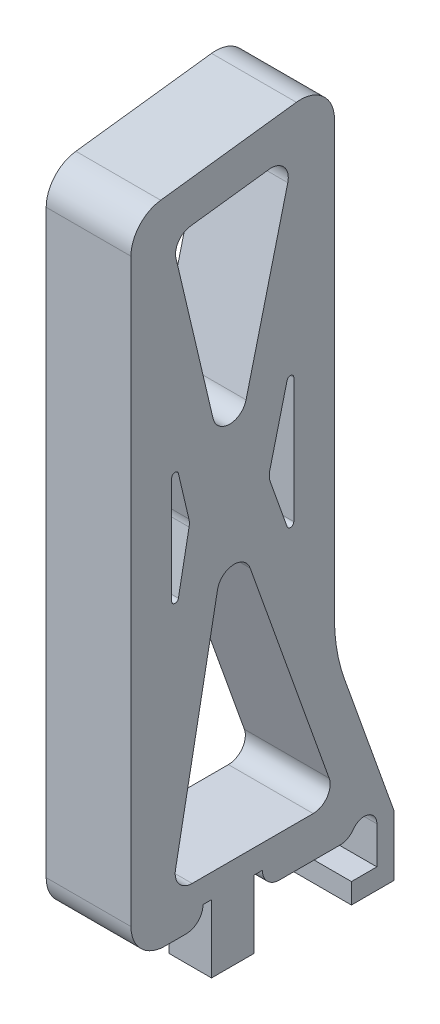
ISO-10303-21;
HEADER;
FILE_DESCRIPTION(('STEP AP214'),'2;1');
FILE_NAME('part.step','',(''),(''),'','','');
FILE_SCHEMA(('AUTOMOTIVE_DESIGN { 1 0 10303 214 1 1 1 1 }'));
ENDSEC;
DATA;
#1=APPLICATION_CONTEXT('core data for automotive mechanical design processes');
#2=APPLICATION_PROTOCOL_DEFINITION('international standard','automotive_design',2000,#1);
#3=PRODUCT_CONTEXT('',#1,'mechanical');
#4=PRODUCT('Part','Part','',(#3));
#5=PRODUCT_RELATED_PRODUCT_CATEGORY('part','',(#4));
#6=PRODUCT_DEFINITION_FORMATION('','',#4);
#7=PRODUCT_DEFINITION_CONTEXT('part definition',#1,'design');
#8=PRODUCT_DEFINITION('design','',#6,#7);
#9=PRODUCT_DEFINITION_SHAPE('','',#8);
#10=(LENGTH_UNIT() NAMED_UNIT(*) SI_UNIT(.MILLI.,.METRE.));
#11=(NAMED_UNIT(*) PLANE_ANGLE_UNIT() SI_UNIT($,.RADIAN.));
#12=(NAMED_UNIT(*) SI_UNIT($,.STERADIAN.) SOLID_ANGLE_UNIT());
#13=UNCERTAINTY_MEASURE_WITH_UNIT(LENGTH_MEASURE(1.E-05),#10,'distance_accuracy_value','');
#14=(GEOMETRIC_REPRESENTATION_CONTEXT(3) GLOBAL_UNCERTAINTY_ASSIGNED_CONTEXT((#13)) GLOBAL_UNIT_ASSIGNED_CONTEXT((#10,
#11,#12)) REPRESENTATION_CONTEXT('',''));
#15=CARTESIAN_POINT('',(0.,0.,0.));
#16=DIRECTION('',(0.,0.,1.));
#17=DIRECTION('',(1.,0.,0.));
#18=AXIS2_PLACEMENT_3D('',#15,#16,#17);
#19=CARTESIAN_POINT('',(5.,0.,0.));
#20=DIRECTION('',(0.,1.,0.));
#21=DIRECTION('',(0.,0.,1.));
#22=AXIS2_PLACEMENT_3D('',#19,#20,#21);
#23=PLANE('',#22);
#24=DIRECTION('',(0.,0.,-1.));
#25=VECTOR('',#24,1.);
#26=CARTESIAN_POINT('',(2.,0.,7.75));
#27=LINE('',#26,#25);
#28=CARTESIAN_POINT('',(2.,0.,8.75));
#29=VERTEX_POINT('',#28);
#30=CARTESIAN_POINT('',(2.,0.,3.25));
#31=VERTEX_POINT('',#30);
#32=EDGE_CURVE('E50',#29,#31,#27,.T.);
#33=ORIENTED_EDGE('',*,*,#32,.F.);
#34=DIRECTION('',(-1.,0.,0.));
#35=VECTOR('',#34,1.);
#36=CARTESIAN_POINT('',(5.,0.,8.75));
#37=LINE('',#36,#35);
#38=CARTESIAN_POINT('',(5.,0.,8.75));
#39=VERTEX_POINT('',#38);
#40=EDGE_CURVE('E579',#29,#39,#37,.F.);
#41=ORIENTED_EDGE('',*,*,#40,.T.);
#42=DIRECTION('',(0.,0.,-1.));
#43=VECTOR('',#42,1.);
#44=CARTESIAN_POINT('',(5.,0.,0.));
#45=LINE('',#44,#43);
#46=CARTESIAN_POINT('',(5.,0.,9.99999999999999));
#47=VERTEX_POINT('',#46);
#48=EDGE_CURVE('E399',#47,#39,#45,.T.);
#49=ORIENTED_EDGE('',*,*,#48,.F.);
#50=DIRECTION('',(-1.,0.,0.));
#51=VECTOR('',#50,1.);
#52=CARTESIAN_POINT('',(5.,0.,9.99999999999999));
#53=LINE('',#52,#51);
#54=CARTESIAN_POINT('',(0.,0.,9.99999999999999));
#55=VERTEX_POINT('',#54);
#56=EDGE_CURVE('E556',#47,#55,#53,.T.);
#57=ORIENTED_EDGE('',*,*,#56,.T.);
#58=DIRECTION('',(0.,0.,-1.));
#59=VECTOR('',#58,1.);
#60=CARTESIAN_POINT('',(0.,0.,0.));
#61=LINE('',#60,#59);
#62=CARTESIAN_POINT('',(0.,0.,-0.313859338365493));
#63=VERTEX_POINT('',#62);
#64=EDGE_CURVE('E410',#55,#63,#61,.T.);
#65=ORIENTED_EDGE('',*,*,#64,.T.);
#66=DIRECTION('',(1.,0.,0.));
#67=VECTOR('',#66,1.);
#68=CARTESIAN_POINT('',(5.,0.,-0.313859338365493));
#69=LINE('',#68,#67);
#70=CARTESIAN_POINT('',(5.,0.,-0.313859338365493));
#71=VERTEX_POINT('',#70);
#72=EDGE_CURVE('E569',#63,#71,#69,.T.);
#73=ORIENTED_EDGE('',*,*,#72,.T.);
#74=CARTESIAN_POINT('',(5.,0.,3.25));
#75=VERTEX_POINT('',#74);
#76=EDGE_CURVE('E397',#75,#71,#45,.T.);
#77=ORIENTED_EDGE('',*,*,#76,.F.);
#78=DIRECTION('',(1.,0.,0.));
#79=VECTOR('',#78,1.);
#80=CARTESIAN_POINT('',(5.,0.,3.25));
#81=LINE('',#80,#79);
#82=EDGE_CURVE('E577',#75,#31,#81,.F.);
#83=ORIENTED_EDGE('',*,*,#82,.T.);
#84=EDGE_LOOP('',(#33,#41,#49,#57,#65,#73,#77,#83));
#85=FACE_BOUND('',#84,.T.);
#86=ADVANCED_FACE('F35',(#85),#23,.F.);
#87=CARTESIAN_POINT('',(5.,0.,12.));
#88=DIRECTION('',(0.,0.,-1.));
#89=DIRECTION('',(-1.,0.,0.));
#90=AXIS2_PLACEMENT_3D('',#87,#88,#89);
#91=PLANE('',#90);
#92=DIRECTION('',(0.,-1.,0.));
#93=VECTOR('',#92,1.);
#94=CARTESIAN_POINT('',(0.,0.,12.));
#95=LINE('',#94,#93);
#96=CARTESIAN_POINT('',(0.,36.2335302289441,12.));
#97=VERTEX_POINT('',#96);
#98=CARTESIAN_POINT('',(0.,2.,12.));
#99=VERTEX_POINT('',#98);
#100=EDGE_CURVE('E393',#97,#99,#95,.T.);
#101=ORIENTED_EDGE('',*,*,#100,.T.);
#102=DIRECTION('',(-1.,0.,0.));
#103=VECTOR('',#102,1.);
#104=CARTESIAN_POINT('',(5.,2.,12.));
#105=LINE('',#104,#103);
#106=CARTESIAN_POINT('',(5.,2.,12.));
#107=VERTEX_POINT('',#106);
#108=EDGE_CURVE('E561',#99,#107,#105,.F.);
#109=ORIENTED_EDGE('',*,*,#108,.T.);
#110=DIRECTION('',(0.,-1.,0.));
#111=VECTOR('',#110,1.);
#112=CARTESIAN_POINT('',(5.,0.,12.));
#113=LINE('',#112,#111);
#114=CARTESIAN_POINT('',(5.,36.2335302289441,12.));
#115=VERTEX_POINT('',#114);
#116=EDGE_CURVE('E394',#115,#107,#113,.T.);
#117=ORIENTED_EDGE('',*,*,#116,.F.);
#118=DIRECTION('',(-1.,0.,0.));
#119=VECTOR('',#118,1.);
#120=CARTESIAN_POINT('',(5.,36.2335302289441,12.));
#121=LINE('',#120,#119);
#122=EDGE_CURVE('E538',#115,#97,#121,.T.);
#123=ORIENTED_EDGE('',*,*,#122,.T.);
#124=EDGE_LOOP('',(#101,#109,#117,#123));
#125=FACE_BOUND('',#124,.T.);
#126=ADVANCED_FACE('F765',(#125),#91,.F.);
#127=CARTESIAN_POINT('',(5.,39.5,0.));
#128=DIRECTION('',(0.,0.,1.));
#129=DIRECTION('',(0.,-1.,0.));
#130=AXIS2_PLACEMENT_3D('',#127,#128,#129);
#131=PLANE('',#130);
#132=DIRECTION('',(0.,1.,0.));
#133=VECTOR('',#132,1.);
#134=CARTESIAN_POINT('',(0.,39.5,0.));
#135=LINE('',#134,#133);
#136=CARTESIAN_POINT('',(0.,11.7307321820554,0.));
#137=VERTEX_POINT('',#136);
#138=CARTESIAN_POINT('',(0.,37.2342369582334,0.));
#139=VERTEX_POINT('',#138);
#140=EDGE_CURVE('E413',#137,#139,#135,.T.);
#141=ORIENTED_EDGE('',*,*,#140,.T.);
#142=DIRECTION('',(-1.,0.,0.));
#143=VECTOR('',#142,1.);
#144=CARTESIAN_POINT('',(5.,37.2342369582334,0.));
#145=LINE('',#144,#143);
#146=CARTESIAN_POINT('',(5.,37.2342369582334,0.));
#147=VERTEX_POINT('',#146);
#148=EDGE_CURVE('E554',#139,#147,#145,.F.);
#149=ORIENTED_EDGE('',*,*,#148,.T.);
#150=DIRECTION('',(0.,1.,0.));
#151=VECTOR('',#150,1.);
#152=CARTESIAN_POINT('',(5.,39.5,0.));
#153=LINE('',#152,#151);
#154=CARTESIAN_POINT('',(5.,11.7307321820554,0.));
#155=VERTEX_POINT('',#154);
#156=EDGE_CURVE('E401',#155,#147,#153,.T.);
#157=ORIENTED_EDGE('',*,*,#156,.F.);
#158=DIRECTION('',(-1.,0.,0.));
#159=VECTOR('',#158,1.);
#160=CARTESIAN_POINT('',(0.,11.7307321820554,0.));
#161=LINE('',#160,#159);
#162=EDGE_CURVE('E407',#155,#137,#161,.T.);
#163=ORIENTED_EDGE('',*,*,#162,.T.);
#164=EDGE_LOOP('',(#141,#149,#157,#163));
#165=FACE_BOUND('',#164,.T.);
#166=ADVANCED_FACE('F749',(#165),#131,.F.);
#167=CARTESIAN_POINT('',(5.,37.9989399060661,12.));
#168=DIRECTION('',(0.,-0.992267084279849,-0.124121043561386));
#169=DIRECTION('',(0.,0.124121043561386,-0.992267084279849));
#170=AXIS2_PLACEMENT_3D('',#167,#168,#169);
#171=PLANE('',#170);
#172=DIRECTION('',(0.,-0.124121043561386,0.992267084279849));
#173=VECTOR('',#172,1.);
#174=CARTESIAN_POINT('',(0.,37.9989399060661,12.));
#175=LINE('',#174,#173);
#176=CARTESIAN_POINT('',(0.,39.2187711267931,2.24824208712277));
#177=VERTEX_POINT('',#176);
#178=CARTESIAN_POINT('',(0.,38.2180643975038,10.2482420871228));
#179=VERTEX_POINT('',#178);
#180=EDGE_CURVE('E398',#177,#179,#175,.T.);
#181=ORIENTED_EDGE('',*,*,#180,.T.);
#182=DIRECTION('',(-1.,0.,0.));
#183=VECTOR('',#182,1.);
#184=CARTESIAN_POINT('',(5.,38.2180643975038,10.2482420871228));
#185=LINE('',#184,#183);
#186=CARTESIAN_POINT('',(5.,38.2180643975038,10.2482420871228));
#187=VERTEX_POINT('',#186);
#188=EDGE_CURVE('E548',#179,#187,#185,.F.);
#189=ORIENTED_EDGE('',*,*,#188,.T.);
#190=DIRECTION('',(0.,-0.124121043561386,0.992267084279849));
#191=VECTOR('',#190,1.);
#192=CARTESIAN_POINT('',(5.,37.9989399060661,12.));
#193=LINE('',#192,#191);
#194=CARTESIAN_POINT('',(5.,39.2187711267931,2.24824208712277));
#195=VERTEX_POINT('',#194);
#196=EDGE_CURVE('E404',#195,#187,#193,.T.);
#197=ORIENTED_EDGE('',*,*,#196,.F.);
#198=DIRECTION('',(-1.,0.,0.));
#199=VECTOR('',#198,1.);
#200=CARTESIAN_POINT('',(5.,39.2187711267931,2.24824208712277));
#201=LINE('',#200,#199);
#202=EDGE_CURVE('E545',#195,#177,#201,.T.);
#203=ORIENTED_EDGE('',*,*,#202,.T.);
#204=EDGE_LOOP('',(#181,#189,#197,#203));
#205=FACE_BOUND('',#204,.T.);
#206=ADVANCED_FACE('F758',(#205),#171,.F.);
#207=CARTESIAN_POINT('',(5.,0.,0.));
#208=DIRECTION('',(1.,0.,0.));
#209=DIRECTION('',(0.,0.,-1.));
#210=AXIS2_PLACEMENT_3D('',#207,#208,#209);
#211=PLANE('',#210);
#212=ORIENTED_EDGE('',*,*,#48,.T.);
#213=CARTESIAN_POINT('',(5.,0.999999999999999,8.75));
#214=DIRECTION('',(1.,0.,0.));
#215=DIRECTION('',(0.,0.,-1.));
#216=AXIS2_PLACEMENT_3D('',#213,#214,#215);
#217=CIRCLE('',#216,1.);
#218=CARTESIAN_POINT('',(5.,0.999999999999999,7.75));
#219=VERTEX_POINT('',#218);
#220=EDGE_CURVE('E583',#39,#219,#217,.T.);
#221=ORIENTED_EDGE('',*,*,#220,.T.);
#222=DIRECTION('',(0.,0.,-1.));
#223=VECTOR('',#222,1.);
#224=CARTESIAN_POINT('',(5.,1.,0.));
#225=LINE('',#224,#223);
#226=CARTESIAN_POINT('',(5.,0.999999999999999,7.25));
#227=VERTEX_POINT('',#226);
#228=EDGE_CURVE('E566',#219,#227,#225,.T.);
#229=ORIENTED_EDGE('',*,*,#228,.T.);
#230=DIRECTION('',(0.,1.,0.));
#231=VECTOR('',#230,1.);
#232=CARTESIAN_POINT('',(5.,-3.,7.25));
#233=LINE('',#232,#231);
#234=CARTESIAN_POINT('',(5.,-3.,7.25));
#235=VERTEX_POINT('',#234);
#236=EDGE_CURVE('E391',#235,#227,#233,.T.);
#237=ORIENTED_EDGE('',*,*,#236,.F.);
#238=DIRECTION('',(0.,0.,1.));
#239=VECTOR('',#238,1.);
#240=CARTESIAN_POINT('',(5.,-3.,4.75));
#241=LINE('',#240,#239);
#242=CARTESIAN_POINT('',(5.,-3.,4.75));
#243=VERTEX_POINT('',#242);
#244=EDGE_CURVE('E366',#243,#235,#241,.T.);
#245=ORIENTED_EDGE('',*,*,#244,.F.);
#246=DIRECTION('',(0.,1.,0.));
#247=VECTOR('',#246,1.);
#248=CARTESIAN_POINT('',(5.,-3.,4.75));
#249=LINE('',#248,#247);
#250=CARTESIAN_POINT('',(5.,0.999999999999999,4.75));
#251=VERTEX_POINT('',#250);
#252=EDGE_CURVE('E385',#243,#251,#249,.T.);
#253=ORIENTED_EDGE('',*,*,#252,.T.);
#254=CARTESIAN_POINT('',(5.,1.,4.25));
#255=VERTEX_POINT('',#254);
#256=EDGE_CURVE('E565',#251,#255,#225,.T.);
#257=ORIENTED_EDGE('',*,*,#256,.T.);
#258=CARTESIAN_POINT('',(5.,1.,3.25));
#259=DIRECTION('',(1.,0.,0.));
#260=DIRECTION('',(0.,0.,-1.));
#261=AXIS2_PLACEMENT_3D('',#258,#259,#260);
#262=CIRCLE('',#261,1.);
#263=EDGE_CURVE('E581',#255,#75,#262,.T.);
#264=ORIENTED_EDGE('',*,*,#263,.T.);
#265=ORIENTED_EDGE('',*,*,#76,.T.);
#266=CARTESIAN_POINT('',(5.,1.,-0.313859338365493));
#267=DIRECTION('',(1.,0.,0.));
#268=DIRECTION('',(0.,0.,-1.));
#269=AXIS2_PLACEMENT_3D('',#266,#267,#268);
#270=CIRCLE('',#269,1.);
#271=CARTESIAN_POINT('',(5.,0.428571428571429,-1.13451114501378));
#272=VERTEX_POINT('',#271);
#273=EDGE_CURVE('E357',#71,#272,#270,.T.);
#274=ORIENTED_EDGE('',*,*,#273,.T.);
#275=CARTESIAN_POINT('',(5.,0.,-1.75));
#276=DIRECTION('',(1.,0.,0.));
#277=DIRECTION('',(0.,0.,-1.));
#278=AXIS2_PLACEMENT_3D('',#275,#276,#277);
#279=CIRCLE('',#278,0.75);
#280=CARTESIAN_POINT('',(5.,0.,-2.5));
#281=VERTEX_POINT('',#280);
#282=EDGE_CURVE('E339',#281,#272,#279,.T.);
#283=ORIENTED_EDGE('',*,*,#282,.F.);
#284=DIRECTION('',(0.,-1.,0.));
#285=VECTOR('',#284,1.);
#286=CARTESIAN_POINT('',(5.,0.,-2.5));
#287=LINE('',#286,#285);
#288=CARTESIAN_POINT('',(5.,-2.2,-2.5));
#289=VERTEX_POINT('',#288);
#290=EDGE_CURVE('E355',#281,#289,#287,.T.);
#291=ORIENTED_EDGE('',*,*,#290,.T.);
#292=DIRECTION('',(0.,0.,1.));
#293=VECTOR('',#292,1.);
#294=CARTESIAN_POINT('',(5.,-2.2,-1.));
#295=LINE('',#294,#293);
#296=CARTESIAN_POINT('',(5.,-2.2,-1.));
#297=VERTEX_POINT('',#296);
#298=EDGE_CURVE('E690',#289,#297,#295,.T.);
#299=ORIENTED_EDGE('',*,*,#298,.T.);
#300=DIRECTION('',(0.,-1.,0.));
#301=VECTOR('',#300,1.);
#302=CARTESIAN_POINT('',(5.,-3.4,-1.));
#303=LINE('',#302,#301);
#304=CARTESIAN_POINT('',(5.,-3.4,-1.));
#305=VERTEX_POINT('',#304);
#306=EDGE_CURVE('E704',#297,#305,#303,.T.);
#307=ORIENTED_EDGE('',*,*,#306,.T.);
#308=DIRECTION('',(0.,0.,-1.));
#309=VECTOR('',#308,1.);
#310=CARTESIAN_POINT('',(5.,-3.4,-3.5));
#311=LINE('',#310,#309);
#312=CARTESIAN_POINT('',(5.,-3.4,-3.5));
#313=VERTEX_POINT('',#312);
#314=EDGE_CURVE('E707',#305,#313,#311,.T.);
#315=ORIENTED_EDGE('',*,*,#314,.T.);
#316=DIRECTION('',(0.,1.,0.));
#317=VECTOR('',#316,1.);
#318=CARTESIAN_POINT('',(5.,-2.2,-3.5));
#319=LINE('',#318,#317);
#320=CARTESIAN_POINT('',(5.,0.191550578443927,-3.5));
#321=VERTEX_POINT('',#320);
#322=EDGE_CURVE('E362',#313,#321,#319,.T.);
#323=ORIENTED_EDGE('',*,*,#322,.T.);
#324=DIRECTION('',(0.,0.941833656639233,0.336079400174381));
#325=VECTOR('',#324,1.);
#326=CARTESIAN_POINT('',(5.,0.191550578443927,-3.5));
#327=LINE('',#326,#325);
#328=CARTESIAN_POINT('',(5.,8.36993818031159,-0.581663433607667));
#329=VERTEX_POINT('',#328);
#330=EDGE_CURVE('E363',#321,#329,#327,.T.);
#331=ORIENTED_EDGE('',*,*,#330,.T.);
#332=CARTESIAN_POINT('',(5.,11.7307321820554,-10.));
#333=DIRECTION('',(1.,0.,0.));
#334=DIRECTION('',(0.,0.,-1.));
#335=AXIS2_PLACEMENT_3D('',#332,#333,#334);
#336=CIRCLE('',#335,10.);
#337=EDGE_CURVE('E424',#329,#155,#336,.F.);
#338=ORIENTED_EDGE('',*,*,#337,.T.);
#339=ORIENTED_EDGE('',*,*,#156,.T.);
#340=CARTESIAN_POINT('',(5.,37.2342369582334,2.));
#341=DIRECTION('',(1.,0.,0.));
#342=DIRECTION('',(0.,0.,-1.));
#343=AXIS2_PLACEMENT_3D('',#340,#341,#342);
#344=CIRCLE('',#343,2.);
#345=EDGE_CURVE('E550',#147,#195,#344,.T.);
#346=ORIENTED_EDGE('',*,*,#345,.T.);
#347=ORIENTED_EDGE('',*,*,#196,.T.);
#348=CARTESIAN_POINT('',(5.,36.2335302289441,9.99999999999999));
#349=DIRECTION('',(1.,0.,0.));
#350=DIRECTION('',(0.,0.,-1.));
#351=AXIS2_PLACEMENT_3D('',#348,#349,#350);
#352=CIRCLE('',#351,2.);
#353=EDGE_CURVE('E552',#187,#115,#352,.T.);
#354=ORIENTED_EDGE('',*,*,#353,.T.);
#355=ORIENTED_EDGE('',*,*,#116,.T.);
#356=CARTESIAN_POINT('',(5.,2.,9.99999999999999));
#357=DIRECTION('',(1.,0.,0.));
#358=DIRECTION('',(0.,0.,-1.));
#359=AXIS2_PLACEMENT_3D('',#356,#357,#358);
#360=CIRCLE('',#359,2.);
#361=EDGE_CURVE('E563',#107,#47,#360,.T.);
#362=ORIENTED_EDGE('',*,*,#361,.T.);
#363=EDGE_LOOP('',(#212,#221,#229,#237,#245,#253,#257,#264,#265,#274,#283,#291,#299,#307,#315,
#323,#331,#338,#339,#346,#347,#354,#355,#362));
#364=FACE_BOUND('',#363,.T.);
#365=DIRECTION('',(0.,1.,0.));
#366=VECTOR('',#365,1.);
#367=CARTESIAN_POINT('',(5.,16.725793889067,2.4));
#368=LINE('',#367,#366);
#369=CARTESIAN_POINT('',(5.,17.881374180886,2.4));
#370=VERTEX_POINT('',#369);
#371=CARTESIAN_POINT('',(5.,25.2410420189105,2.4));
#372=VERTEX_POINT('',#371);
#373=EDGE_CURVE('E639',#370,#372,#368,.T.);
#374=ORIENTED_EDGE('',*,*,#373,.F.);
#375=CARTESIAN_POINT('',(5.,17.881374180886,2.6));
#376=DIRECTION('',(1.,0.,0.));
#377=DIRECTION('',(0.,0.,-1.));
#378=AXIS2_PLACEMENT_3D('',#375,#376,#377);
#379=CIRCLE('',#378,0.2);
#380=CARTESIAN_POINT('',(5.,17.8141583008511,2.78836673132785));
#381=VERTEX_POINT('',#380);
#382=EDGE_CURVE('E526',#370,#381,#379,.F.);
#383=ORIENTED_EDGE('',*,*,#382,.T.);
#384=DIRECTION('',(0.,-0.941833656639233,-0.33607940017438));
#385=VECTOR('',#384,1.);
#386=CARTESIAN_POINT('',(5.,20.8998411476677,3.88944698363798));
#387=LINE('',#386,#385);
#388=CARTESIAN_POINT('',(5.,20.6150385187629,3.78781938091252));
#389=VERTEX_POINT('',#388);
#390=EDGE_CURVE('E650',#389,#381,#387,.T.);
#391=ORIENTED_EDGE('',*,*,#390,.F.);
#392=CARTESIAN_POINT('',(5.,20.9511179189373,2.84598572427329));
#393=DIRECTION('',(1.,0.,0.));
#394=DIRECTION('',(0.,0.,-1.));
#395=AXIS2_PLACEMENT_3D('',#392,#393,#394);
#396=CIRCLE('',#395,1.);
#397=CARTESIAN_POINT('',(5.,21.193235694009,3.81623259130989));
#398=VERTEX_POINT('',#397);
#399=EDGE_CURVE('E468',#389,#398,#396,.F.);
#400=ORIENTED_EDGE('',*,*,#399,.T.);
#401=DIRECTION('',(0.,-0.970246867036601,0.242117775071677));
#402=VECTOR('',#401,1.);
#403=CARTESIAN_POINT('',(5.,26.8685531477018,2.4));
#404=LINE('',#403,#402);
#405=CARTESIAN_POINT('',(5.,25.2894655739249,2.79404937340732));
#406=VERTEX_POINT('',#405);
#407=EDGE_CURVE('E658',#406,#398,#404,.T.);
#408=ORIENTED_EDGE('',*,*,#407,.F.);
#409=CARTESIAN_POINT('',(5.,25.2410420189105,2.6));
#410=DIRECTION('',(1.,0.,0.));
#411=DIRECTION('',(0.,0.,-1.));
#412=AXIS2_PLACEMENT_3D('',#409,#410,#411);
#413=CIRCLE('',#412,0.2);
#414=EDGE_CURVE('E522',#406,#372,#413,.F.);
#415=ORIENTED_EDGE('',*,*,#414,.T.);
#416=EDGE_LOOP('',(#374,#383,#391,#400,#408,#415));
#417=FACE_BOUND('',#416,.T.);
#418=DIRECTION('',(0.,-0.973314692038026,-0.229474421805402));
#419=VECTOR('',#418,1.);
#420=CARTESIAN_POINT('',(5.,21.5076211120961,6.21137735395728));
#421=LINE('',#420,#419);
#422=CARTESIAN_POINT('',(5.,34.7968869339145,9.34453317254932));
#423=VERTEX_POINT('',#422);
#424=CARTESIAN_POINT('',(5.,25.5189195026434,7.15710475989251));
#425=VERTEX_POINT('',#424);
#426=EDGE_CURVE('E655',#423,#425,#421,.T.);
#427=ORIENTED_EDGE('',*,*,#426,.F.);
#428=CARTESIAN_POINT('',(5.,35.0263613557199,8.3712184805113));
#429=DIRECTION('',(1.,0.,0.));
#430=DIRECTION('',(0.,0.,-1.));
#431=AXIS2_PLACEMENT_3D('',#428,#429,#430);
#432=CIRCLE('',#431,1.);
#433=CARTESIAN_POINT('',(5.,36.0186284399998,8.49533952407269));
#434=VERTEX_POINT('',#433);
#435=EDGE_CURVE('E478',#423,#434,#432,.F.);
#436=ORIENTED_EDGE('',*,*,#435,.T.);
#437=DIRECTION('',(0.,-0.124121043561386,0.992267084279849));
#438=VECTOR('',#437,1.);
#439=CARTESIAN_POINT('',(5.,35.8804482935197,9.6));
#440=LINE('',#439,#438);
#441=CARTESIAN_POINT('',(5.,36.6000082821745,3.84758549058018));
#442=VERTEX_POINT('',#441);
#443=EDGE_CURVE('E666',#442,#434,#440,.T.);
#444=ORIENTED_EDGE('',*,*,#443,.F.);
#445=CARTESIAN_POINT('',(5.,35.6077411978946,3.7234644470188));
#446=DIRECTION('',(1.,0.,0.));
#447=DIRECTION('',(0.,0.,-1.));
#448=AXIS2_PLACEMENT_3D('',#445,#446,#447);
#449=CIRCLE('',#448,1.);
#450=CARTESIAN_POINT('',(5.,35.3656234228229,2.75321757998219));
#451=VERTEX_POINT('',#450);
#452=EDGE_CURVE('E482',#442,#451,#449,.F.);
#453=ORIENTED_EDGE('',*,*,#452,.T.);
#454=DIRECTION('',(0.,0.970246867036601,-0.242117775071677));
#455=VECTOR('',#454,1.);
#456=CARTESIAN_POINT('',(5.,36.7810843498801,2.4));
#457=LINE('',#456,#455);
#458=CARTESIAN_POINT('',(5.,25.5062761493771,5.21354320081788));
#459=VERTEX_POINT('',#458);
#460=EDGE_CURVE('E675',#459,#451,#457,.T.);
#461=ORIENTED_EDGE('',*,*,#460,.F.);
#462=CARTESIAN_POINT('',(5.,25.7483939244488,6.18379006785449));
#463=DIRECTION('',(1.,0.,0.));
#464=DIRECTION('',(0.,0.,-1.));
#465=AXIS2_PLACEMENT_3D('',#462,#463,#464);
#466=CIRCLE('',#465,1.);
#467=EDGE_CURVE('E486',#459,#425,#466,.F.);
#468=ORIENTED_EDGE('',*,*,#467,.T.);
#469=EDGE_LOOP('',(#427,#436,#444,#453,#461,#468));
#470=FACE_BOUND('',#469,.T.);
#471=DIRECTION('',(0.,-1.,0.));
#472=VECTOR('',#471,1.);
#473=CARTESIAN_POINT('',(5.,25.4217663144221,9.6));
#474=LINE('',#473,#472);
#475=CARTESIAN_POINT('',(5.,23.7019104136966,9.6));
#476=VERTEX_POINT('',#475);
#477=CARTESIAN_POINT('',(5.,17.4067086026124,9.6));
#478=VERTEX_POINT('',#477);
#479=EDGE_CURVE('E623',#476,#478,#474,.T.);
#480=ORIENTED_EDGE('',*,*,#479,.F.);
#481=CARTESIAN_POINT('',(5.,23.7019104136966,9.4));
#482=DIRECTION('',(1.,0.,0.));
#483=DIRECTION('',(0.,0.,-1.));
#484=AXIS2_PLACEMENT_3D('',#481,#482,#483);
#485=CIRCLE('',#484,0.2);
#486=CARTESIAN_POINT('',(5.,23.7478052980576,9.20533706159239));
#487=VERTEX_POINT('',#486);
#488=EDGE_CURVE('E534',#476,#487,#485,.F.);
#489=ORIENTED_EDGE('',*,*,#488,.T.);
#490=DIRECTION('',(0.,0.973314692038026,0.229474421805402));
#491=VECTOR('',#490,1.);
#492=CARTESIAN_POINT('',(5.,20.8998411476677,8.5338842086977));
#493=LINE('',#492,#491);
#494=CARTESIAN_POINT('',(5.,21.1067785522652,8.58267299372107));
#495=VERTEX_POINT('',#494);
#496=EDGE_CURVE('E634',#495,#487,#493,.T.);
#497=ORIENTED_EDGE('',*,*,#496,.F.);
#498=CARTESIAN_POINT('',(5.,20.8773041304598,9.5559876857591));
#499=DIRECTION('',(1.,0.,0.));
#500=DIRECTION('',(0.,0.,-1.));
#501=AXIS2_PLACEMENT_3D('',#498,#499,#500);
#502=CIRCLE('',#501,1.);
#503=CARTESIAN_POINT('',(5.,20.6909543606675,8.5735042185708));
#504=VERTEX_POINT('',#503);
#505=EDGE_CURVE('E473',#495,#504,#502,.F.);
#506=ORIENTED_EDGE('',*,*,#505,.T.);
#507=DIRECTION('',(0.,0.982483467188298,-0.186349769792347));
#508=VECTOR('',#507,1.);
#509=CARTESIAN_POINT('',(5.,15.2790070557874,9.6));
#510=LINE('',#509,#508);
#511=CARTESIAN_POINT('',(5.,17.3694386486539,9.20350330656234));
#512=VERTEX_POINT('',#511);
#513=EDGE_CURVE('E642',#512,#504,#510,.T.);
#514=ORIENTED_EDGE('',*,*,#513,.F.);
#515=CARTESIAN_POINT('',(5.,17.4067086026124,9.4));
#516=DIRECTION('',(1.,0.,0.));
#517=DIRECTION('',(0.,0.,-1.));
#518=AXIS2_PLACEMENT_3D('',#515,#516,#517);
#519=CIRCLE('',#518,0.2);
#520=EDGE_CURVE('E530',#512,#478,#519,.F.);
#521=ORIENTED_EDGE('',*,*,#520,.T.);
#522=EDGE_LOOP('',(#480,#489,#497,#506,#514,#521));
#523=FACE_BOUND('',#522,.T.);
#524=DIRECTION('',(0.,-0.982483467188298,0.186349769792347));
#525=VECTOR('',#524,1.);
#526=CARTESIAN_POINT('',(5.,20.2656819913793,6.21137735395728));
#527=LINE('',#526,#525);
#528=CARTESIAN_POINT('',(5.,16.6467995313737,6.89777863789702));
#529=VERTEX_POINT('',#528);
#530=CARTESIAN_POINT('',(5.,3.58634976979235,9.37498246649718));
#531=VERTEX_POINT('',#530);
#532=EDGE_CURVE('E672',#529,#531,#527,.T.);
#533=ORIENTED_EDGE('',*,*,#532,.F.);
#534=CARTESIAN_POINT('',(5.,16.4604497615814,5.91529517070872));
#535=DIRECTION('',(1.,0.,0.));
#536=DIRECTION('',(0.,0.,-1.));
#537=AXIS2_PLACEMENT_3D('',#534,#535,#536);
#538=CIRCLE('',#537,1.);
#539=CARTESIAN_POINT('',(5.,16.7965291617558,4.97346151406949));
#540=VERTEX_POINT('',#539);
#541=EDGE_CURVE('E498',#529,#540,#538,.F.);
#542=ORIENTED_EDGE('',*,*,#541,.T.);
#543=DIRECTION('',(0.,0.941833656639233,0.336079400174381));
#544=VECTOR('',#543,1.);
#545=CARTESIAN_POINT('',(5.,2.4,-0.163726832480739));
#546=LINE('',#545,#544);
#547=CARTESIAN_POINT('',(5.,3.73607940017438,0.313033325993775));
#548=VERTEX_POINT('',#547);
#549=EDGE_CURVE('E684',#548,#540,#546,.T.);
#550=ORIENTED_EDGE('',*,*,#549,.F.);
#551=CARTESIAN_POINT('',(5.,3.4,1.25486698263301));
#552=DIRECTION('',(1.,0.,0.));
#553=DIRECTION('',(0.,0.,-1.));
#554=AXIS2_PLACEMENT_3D('',#551,#552,#553);
#555=CIRCLE('',#554,1.);
#556=CARTESIAN_POINT('',(5.,2.4,1.25486698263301));
#557=VERTEX_POINT('',#556);
#558=EDGE_CURVE('E494',#548,#557,#555,.F.);
#559=ORIENTED_EDGE('',*,*,#558,.T.);
#560=DIRECTION('',(0.,0.,-1.));
#561=VECTOR('',#560,1.);
#562=CARTESIAN_POINT('',(5.,2.4,9.6));
#563=LINE('',#562,#561);
#564=CARTESIAN_POINT('',(5.,2.4,8.39249899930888));
#565=VERTEX_POINT('',#564);
#566=EDGE_CURVE('E693',#565,#557,#563,.T.);
#567=ORIENTED_EDGE('',*,*,#566,.F.);
#568=CARTESIAN_POINT('',(5.,3.4,8.39249899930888));
#569=DIRECTION('',(1.,0.,0.));
#570=DIRECTION('',(0.,0.,-1.));
#571=AXIS2_PLACEMENT_3D('',#568,#569,#570);
#572=CIRCLE('',#571,1.);
#573=EDGE_CURVE('E490',#565,#531,#572,.F.);
#574=ORIENTED_EDGE('',*,*,#573,.T.);
#575=EDGE_LOOP('',(#533,#542,#550,#559,#567,#574));
#576=FACE_BOUND('',#575,.T.);
#577=ADVANCED_FACE('F353',(#364,#417,#470,#523,#576),#211,.T.);
#578=CARTESIAN_POINT('',(0.,0.,0.));
#579=DIRECTION('',(1.,0.,0.));
#580=DIRECTION('',(0.,0.,-1.));
#581=AXIS2_PLACEMENT_3D('',#578,#579,#580);
#582=PLANE('',#581);
#583=DIRECTION('',(0.,1.,0.));
#584=VECTOR('',#583,1.);
#585=CARTESIAN_POINT('',(0.,16.725793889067,2.4));
#586=LINE('',#585,#584);
#587=CARTESIAN_POINT('',(0.,17.881374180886,2.4));
#588=VERTEX_POINT('',#587);
#589=CARTESIAN_POINT('',(0.,25.2410420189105,2.4));
#590=VERTEX_POINT('',#589);
#591=EDGE_CURVE('E646',#588,#590,#586,.T.);
#592=ORIENTED_EDGE('',*,*,#591,.T.);
#593=CARTESIAN_POINT('',(0.,25.2410420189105,2.6));
#594=DIRECTION('',(1.,0.,0.));
#595=DIRECTION('',(0.,0.,-1.));
#596=AXIS2_PLACEMENT_3D('',#593,#594,#595);
#597=CIRCLE('',#596,0.2);
#598=CARTESIAN_POINT('',(0.,25.2894655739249,2.79404937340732));
#599=VERTEX_POINT('',#598);
#600=EDGE_CURVE('E524',#590,#599,#597,.T.);
#601=ORIENTED_EDGE('',*,*,#600,.T.);
#602=DIRECTION('',(0.,-0.970246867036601,0.242117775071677));
#603=VECTOR('',#602,1.);
#604=CARTESIAN_POINT('',(0.,26.8685531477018,2.4));
#605=LINE('',#604,#603);
#606=CARTESIAN_POINT('',(0.,21.193235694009,3.81623259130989));
#607=VERTEX_POINT('',#606);
#608=EDGE_CURVE('E649',#599,#607,#605,.T.);
#609=ORIENTED_EDGE('',*,*,#608,.T.);
#610=CARTESIAN_POINT('',(0.,20.9511179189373,2.84598572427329));
#611=DIRECTION('',(1.,0.,0.));
#612=DIRECTION('',(0.,0.,-1.));
#613=AXIS2_PLACEMENT_3D('',#610,#611,#612);
#614=CIRCLE('',#613,1.);
#615=CARTESIAN_POINT('',(0.,20.6150385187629,3.78781938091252));
#616=VERTEX_POINT('',#615);
#617=EDGE_CURVE('E471',#607,#616,#614,.T.);
#618=ORIENTED_EDGE('',*,*,#617,.T.);
#619=DIRECTION('',(0.,-0.941833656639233,-0.33607940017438));
#620=VECTOR('',#619,1.);
#621=CARTESIAN_POINT('',(0.,20.8998411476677,3.88944698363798));
#622=LINE('',#621,#620);
#623=CARTESIAN_POINT('',(0.,17.8141583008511,2.78836673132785));
#624=VERTEX_POINT('',#623);
#625=EDGE_CURVE('E652',#616,#624,#622,.T.);
#626=ORIENTED_EDGE('',*,*,#625,.T.);
#627=CARTESIAN_POINT('',(0.,17.881374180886,2.6));
#628=DIRECTION('',(1.,0.,0.));
#629=DIRECTION('',(0.,0.,-1.));
#630=AXIS2_PLACEMENT_3D('',#627,#628,#629);
#631=CIRCLE('',#630,0.2);
#632=EDGE_CURVE('E528',#624,#588,#631,.T.);
#633=ORIENTED_EDGE('',*,*,#632,.T.);
#634=EDGE_LOOP('',(#592,#601,#609,#618,#626,#633));
#635=FACE_BOUND('',#634,.T.);
#636=DIRECTION('',(0.,0.970246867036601,-0.242117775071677));
#637=VECTOR('',#636,1.);
#638=CARTESIAN_POINT('',(0.,36.7810843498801,2.4));
#639=LINE('',#638,#637);
#640=CARTESIAN_POINT('',(0.,25.5062761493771,5.21354320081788));
#641=VERTEX_POINT('',#640);
#642=CARTESIAN_POINT('',(0.,35.3656234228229,2.75321757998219));
#643=VERTEX_POINT('',#642);
#644=EDGE_CURVE('E665',#641,#643,#639,.T.);
#645=ORIENTED_EDGE('',*,*,#644,.T.);
#646=CARTESIAN_POINT('',(0.,35.6077411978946,3.7234644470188));
#647=DIRECTION('',(1.,0.,0.));
#648=DIRECTION('',(0.,0.,-1.));
#649=AXIS2_PLACEMENT_3D('',#646,#647,#648);
#650=CIRCLE('',#649,1.);
#651=CARTESIAN_POINT('',(0.,36.6000082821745,3.84758549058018));
#652=VERTEX_POINT('',#651);
#653=EDGE_CURVE('E484',#643,#652,#650,.T.);
#654=ORIENTED_EDGE('',*,*,#653,.T.);
#655=DIRECTION('',(0.,-0.124121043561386,0.992267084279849));
#656=VECTOR('',#655,1.);
#657=CARTESIAN_POINT('',(0.,35.8804482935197,9.6));
#658=LINE('',#657,#656);
#659=CARTESIAN_POINT('',(0.,36.0186284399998,8.49533952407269));
#660=VERTEX_POINT('',#659);
#661=EDGE_CURVE('E669',#652,#660,#658,.T.);
#662=ORIENTED_EDGE('',*,*,#661,.T.);
#663=CARTESIAN_POINT('',(0.,35.0263613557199,8.3712184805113));
#664=DIRECTION('',(1.,0.,0.));
#665=DIRECTION('',(0.,0.,-1.));
#666=AXIS2_PLACEMENT_3D('',#663,#664,#665);
#667=CIRCLE('',#666,1.);
#668=CARTESIAN_POINT('',(0.,34.7968869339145,9.34453317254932));
#669=VERTEX_POINT('',#668);
#670=EDGE_CURVE('E480',#660,#669,#667,.T.);
#671=ORIENTED_EDGE('',*,*,#670,.T.);
#672=DIRECTION('',(0.,-0.973314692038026,-0.229474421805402));
#673=VECTOR('',#672,1.);
#674=CARTESIAN_POINT('',(0.,21.5076211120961,6.21137735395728));
#675=LINE('',#674,#673);
#676=CARTESIAN_POINT('',(0.,25.5189195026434,7.15710475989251));
#677=VERTEX_POINT('',#676);
#678=EDGE_CURVE('E662',#669,#677,#675,.T.);
#679=ORIENTED_EDGE('',*,*,#678,.T.);
#680=CARTESIAN_POINT('',(0.,25.7483939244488,6.18379006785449));
#681=DIRECTION('',(1.,0.,0.));
#682=DIRECTION('',(0.,0.,-1.));
#683=AXIS2_PLACEMENT_3D('',#680,#681,#682);
#684=CIRCLE('',#683,1.);
#685=EDGE_CURVE('E488',#677,#641,#684,.T.);
#686=ORIENTED_EDGE('',*,*,#685,.T.);
#687=EDGE_LOOP('',(#645,#654,#662,#671,#679,#686));
#688=FACE_BOUND('',#687,.T.);
#689=DIRECTION('',(0.,-1.,0.));
#690=VECTOR('',#689,1.);
#691=CARTESIAN_POINT('',(0.,25.4217663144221,9.6));
#692=LINE('',#691,#690);
#693=CARTESIAN_POINT('',(0.,23.7019104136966,9.6));
#694=VERTEX_POINT('',#693);
#695=CARTESIAN_POINT('',(0.,17.4067086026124,9.6));
#696=VERTEX_POINT('',#695);
#697=EDGE_CURVE('E630',#694,#696,#692,.T.);
#698=ORIENTED_EDGE('',*,*,#697,.T.);
#699=CARTESIAN_POINT('',(0.,17.4067086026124,9.4));
#700=DIRECTION('',(1.,0.,0.));
#701=DIRECTION('',(0.,0.,-1.));
#702=AXIS2_PLACEMENT_3D('',#699,#700,#701);
#703=CIRCLE('',#702,0.2);
#704=CARTESIAN_POINT('',(0.,17.3694386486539,9.20350330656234));
#705=VERTEX_POINT('',#704);
#706=EDGE_CURVE('E532',#696,#705,#703,.T.);
#707=ORIENTED_EDGE('',*,*,#706,.T.);
#708=DIRECTION('',(0.,0.982483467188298,-0.186349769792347));
#709=VECTOR('',#708,1.);
#710=CARTESIAN_POINT('',(0.,15.2790070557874,9.6));
#711=LINE('',#710,#709);
#712=CARTESIAN_POINT('',(0.,20.6909543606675,8.5735042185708));
#713=VERTEX_POINT('',#712);
#714=EDGE_CURVE('E633',#705,#713,#711,.T.);
#715=ORIENTED_EDGE('',*,*,#714,.T.);
#716=CARTESIAN_POINT('',(0.,20.8773041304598,9.5559876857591));
#717=DIRECTION('',(1.,0.,0.));
#718=DIRECTION('',(0.,0.,-1.));
#719=AXIS2_PLACEMENT_3D('',#716,#717,#718);
#720=CIRCLE('',#719,1.);
#721=CARTESIAN_POINT('',(0.,21.1067785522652,8.58267299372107));
#722=VERTEX_POINT('',#721);
#723=EDGE_CURVE('E476',#713,#722,#720,.T.);
#724=ORIENTED_EDGE('',*,*,#723,.T.);
#725=DIRECTION('',(0.,0.973314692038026,0.229474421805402));
#726=VECTOR('',#725,1.);
#727=CARTESIAN_POINT('',(0.,20.8998411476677,8.5338842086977));
#728=LINE('',#727,#726);
#729=CARTESIAN_POINT('',(0.,23.7478052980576,9.20533706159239));
#730=VERTEX_POINT('',#729);
#731=EDGE_CURVE('E636',#722,#730,#728,.T.);
#732=ORIENTED_EDGE('',*,*,#731,.T.);
#733=CARTESIAN_POINT('',(0.,23.7019104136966,9.4));
#734=DIRECTION('',(1.,0.,0.));
#735=DIRECTION('',(0.,0.,-1.));
#736=AXIS2_PLACEMENT_3D('',#733,#734,#735);
#737=CIRCLE('',#736,0.2);
#738=EDGE_CURVE('E536',#730,#694,#737,.T.);
#739=ORIENTED_EDGE('',*,*,#738,.T.);
#740=EDGE_LOOP('',(#698,#707,#715,#724,#732,#739));
#741=FACE_BOUND('',#740,.T.);
#742=DIRECTION('',(0.,0.,-1.));
#743=VECTOR('',#742,1.);
#744=CARTESIAN_POINT('',(0.,2.4,9.6));
#745=LINE('',#744,#743);
#746=CARTESIAN_POINT('',(0.,2.4,8.39249899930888));
#747=VERTEX_POINT('',#746);
#748=CARTESIAN_POINT('',(0.,2.4,1.25486698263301));
#749=VERTEX_POINT('',#748);
#750=EDGE_CURVE('E683',#747,#749,#745,.T.);
#751=ORIENTED_EDGE('',*,*,#750,.T.);
#752=CARTESIAN_POINT('',(0.,3.4,1.25486698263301));
#753=DIRECTION('',(1.,0.,0.));
#754=DIRECTION('',(0.,0.,-1.));
#755=AXIS2_PLACEMENT_3D('',#752,#753,#754);
#756=CIRCLE('',#755,1.);
#757=CARTESIAN_POINT('',(0.,3.73607940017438,0.313033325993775));
#758=VERTEX_POINT('',#757);
#759=EDGE_CURVE('E496',#749,#758,#756,.T.);
#760=ORIENTED_EDGE('',*,*,#759,.T.);
#761=DIRECTION('',(0.,0.941833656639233,0.336079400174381));
#762=VECTOR('',#761,1.);
#763=CARTESIAN_POINT('',(0.,2.4,-0.163726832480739));
#764=LINE('',#763,#762);
#765=CARTESIAN_POINT('',(0.,16.7965291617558,4.97346151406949));
#766=VERTEX_POINT('',#765);
#767=EDGE_CURVE('E687',#758,#766,#764,.T.);
#768=ORIENTED_EDGE('',*,*,#767,.T.);
#769=CARTESIAN_POINT('',(0.,16.4604497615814,5.91529517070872));
#770=DIRECTION('',(1.,0.,0.));
#771=DIRECTION('',(0.,0.,-1.));
#772=AXIS2_PLACEMENT_3D('',#769,#770,#771);
#773=CIRCLE('',#772,1.);
#774=CARTESIAN_POINT('',(0.,16.6467995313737,6.89777863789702));
#775=VERTEX_POINT('',#774);
#776=EDGE_CURVE('E500',#766,#775,#773,.T.);
#777=ORIENTED_EDGE('',*,*,#776,.T.);
#778=DIRECTION('',(0.,-0.982483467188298,0.186349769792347));
#779=VECTOR('',#778,1.);
#780=CARTESIAN_POINT('',(0.,20.2656819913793,6.21137735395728));
#781=LINE('',#780,#779);
#782=CARTESIAN_POINT('',(0.,3.58634976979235,9.37498246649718));
#783=VERTEX_POINT('',#782);
#784=EDGE_CURVE('E680',#775,#783,#781,.T.);
#785=ORIENTED_EDGE('',*,*,#784,.T.);
#786=CARTESIAN_POINT('',(0.,3.4,8.39249899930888));
#787=DIRECTION('',(1.,0.,0.));
#788=DIRECTION('',(0.,0.,-1.));
#789=AXIS2_PLACEMENT_3D('',#786,#787,#788);
#790=CIRCLE('',#789,1.);
#791=EDGE_CURVE('E492',#783,#747,#790,.T.);
#792=ORIENTED_EDGE('',*,*,#791,.T.);
#793=EDGE_LOOP('',(#751,#760,#768,#777,#785,#792));
#794=FACE_BOUND('',#793,.T.);
#795=CARTESIAN_POINT('',(0.,0.,-1.75));
#796=DIRECTION('',(1.,0.,0.));
#797=DIRECTION('',(0.,0.,-1.));
#798=AXIS2_PLACEMENT_3D('',#795,#796,#797);
#799=CIRCLE('',#798,0.75);
#800=CARTESIAN_POINT('',(0.,0.,-2.5));
#801=VERTEX_POINT('',#800);
#802=CARTESIAN_POINT('',(0.,0.428571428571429,-1.13451114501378));
#803=VERTEX_POINT('',#802);
#804=EDGE_CURVE('E342',#801,#803,#799,.T.);
#805=ORIENTED_EDGE('',*,*,#804,.T.);
#806=CARTESIAN_POINT('',(0.,1.,-0.313859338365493));
#807=DIRECTION('',(1.,0.,0.));
#808=DIRECTION('',(0.,0.,-1.));
#809=AXIS2_PLACEMENT_3D('',#806,#807,#808);
#810=CIRCLE('',#809,1.);
#811=EDGE_CURVE('E575',#803,#63,#810,.F.);
#812=ORIENTED_EDGE('',*,*,#811,.T.);
#813=ORIENTED_EDGE('',*,*,#64,.F.);
#814=CARTESIAN_POINT('',(0.,2.,9.99999999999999));
#815=DIRECTION('',(1.,0.,0.));
#816=DIRECTION('',(0.,0.,-1.));
#817=AXIS2_PLACEMENT_3D('',#814,#815,#816);
#818=CIRCLE('',#817,2.);
#819=EDGE_CURVE('E559',#55,#99,#818,.F.);
#820=ORIENTED_EDGE('',*,*,#819,.T.);
#821=ORIENTED_EDGE('',*,*,#100,.F.);
#822=CARTESIAN_POINT('',(0.,36.2335302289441,9.99999999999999));
#823=DIRECTION('',(1.,0.,0.));
#824=DIRECTION('',(0.,0.,-1.));
#825=AXIS2_PLACEMENT_3D('',#822,#823,#824);
#826=CIRCLE('',#825,2.);
#827=EDGE_CURVE('E543',#97,#179,#826,.F.);
#828=ORIENTED_EDGE('',*,*,#827,.T.);
#829=ORIENTED_EDGE('',*,*,#180,.F.);
#830=CARTESIAN_POINT('',(0.,37.2342369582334,2.));
#831=DIRECTION('',(1.,0.,0.));
#832=DIRECTION('',(0.,0.,-1.));
#833=AXIS2_PLACEMENT_3D('',#830,#831,#832);
#834=CIRCLE('',#833,2.);
#835=EDGE_CURVE('E541',#177,#139,#834,.F.);
#836=ORIENTED_EDGE('',*,*,#835,.T.);
#837=ORIENTED_EDGE('',*,*,#140,.F.);
#838=CARTESIAN_POINT('',(0.,11.7307321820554,-10.));
#839=DIRECTION('',(1.,0.,0.));
#840=DIRECTION('',(0.,0.,-1.));
#841=AXIS2_PLACEMENT_3D('',#838,#839,#840);
#842=CIRCLE('',#841,10.);
#843=CARTESIAN_POINT('',(0.,8.36993818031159,-0.581663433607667));
#844=VERTEX_POINT('',#843);
#845=EDGE_CURVE('E422',#137,#844,#842,.T.);
#846=ORIENTED_EDGE('',*,*,#845,.T.);
#847=DIRECTION('',(0.,0.941833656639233,0.336079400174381));
#848=VECTOR('',#847,1.);
#849=CARTESIAN_POINT('',(0.,0.191550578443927,-3.5));
#850=LINE('',#849,#848);
#851=CARTESIAN_POINT('',(0.,0.191550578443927,-3.5));
#852=VERTEX_POINT('',#851);
#853=EDGE_CURVE('E369',#852,#844,#850,.T.);
#854=ORIENTED_EDGE('',*,*,#853,.F.);
#855=DIRECTION('',(0.,1.,0.));
#856=VECTOR('',#855,1.);
#857=CARTESIAN_POINT('',(0.,-2.2,-3.5));
#858=LINE('',#857,#856);
#859=CARTESIAN_POINT('',(0.,-3.4,-3.5));
#860=VERTEX_POINT('',#859);
#861=EDGE_CURVE('E374',#860,#852,#858,.T.);
#862=ORIENTED_EDGE('',*,*,#861,.F.);
#863=DIRECTION('',(0.,0.,1.));
#864=VECTOR('',#863,1.);
#865=CARTESIAN_POINT('',(0.,-3.4,-3.5));
#866=LINE('',#865,#864);
#867=CARTESIAN_POINT('',(0.,-3.4,-1.));
#868=VERTEX_POINT('',#867);
#869=EDGE_CURVE('E700',#860,#868,#866,.T.);
#870=ORIENTED_EDGE('',*,*,#869,.T.);
#871=DIRECTION('',(0.,1.,0.));
#872=VECTOR('',#871,1.);
#873=CARTESIAN_POINT('',(0.,-3.4,-1.));
#874=LINE('',#873,#872);
#875=CARTESIAN_POINT('',(0.,-2.2,-1.));
#876=VERTEX_POINT('',#875);
#877=EDGE_CURVE('E698',#868,#876,#874,.T.);
#878=ORIENTED_EDGE('',*,*,#877,.T.);
#879=DIRECTION('',(0.,0.,-1.));
#880=VECTOR('',#879,1.);
#881=CARTESIAN_POINT('',(0.,-2.2,-1.));
#882=LINE('',#881,#880);
#883=CARTESIAN_POINT('',(0.,-2.2,-2.5));
#884=VERTEX_POINT('',#883);
#885=EDGE_CURVE('E348',#876,#884,#882,.T.);
#886=ORIENTED_EDGE('',*,*,#885,.T.);
#887=DIRECTION('',(0.,-1.,0.));
#888=VECTOR('',#887,1.);
#889=CARTESIAN_POINT('',(0.,0.,-2.5));
#890=LINE('',#889,#888);
#891=EDGE_CURVE('E347',#801,#884,#890,.T.);
#892=ORIENTED_EDGE('',*,*,#891,.F.);
#893=EDGE_LOOP('',(#805,#812,#813,#820,#821,#828,#829,#836,#837,#846,#854,#862,#870,#878,#886,#892));
#894=FACE_BOUND('',#893,.T.);
#895=ADVANCED_FACE('F605',(#635,#688,#741,#794,#894),#582,.F.);
#896=CARTESIAN_POINT('',(2.5,-3.,7.25));
#897=DIRECTION('',(0.,0.,-1.));
#898=DIRECTION('',(-1.,0.,0.));
#899=AXIS2_PLACEMENT_3D('',#896,#897,#898);
#900=PLANE('',#899);
#901=ORIENTED_EDGE('',*,*,#236,.T.);
#902=DIRECTION('',(-1.,0.,0.));
#903=VECTOR('',#902,1.);
#904=CARTESIAN_POINT('',(5.,0.999999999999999,7.25));
#905=LINE('',#904,#903);
#906=CARTESIAN_POINT('',(2.5,0.999999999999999,7.25));
#907=VERTEX_POINT('',#906);
#908=EDGE_CURVE('E1258',#227,#907,#905,.T.);
#909=ORIENTED_EDGE('',*,*,#908,.T.);
#910=DIRECTION('',(0.,1.,0.));
#911=VECTOR('',#910,1.);
#912=CARTESIAN_POINT('',(2.5,-3.,7.25));
#913=LINE('',#912,#911);
#914=CARTESIAN_POINT('',(2.5,-3.,7.25));
#915=VERTEX_POINT('',#914);
#916=EDGE_CURVE('E389',#915,#907,#913,.T.);
#917=ORIENTED_EDGE('',*,*,#916,.F.);
#918=DIRECTION('',(-1.,0.,0.));
#919=VECTOR('',#918,1.);
#920=CARTESIAN_POINT('',(2.5,-3.,7.25));
#921=LINE('',#920,#919);
#922=EDGE_CURVE('E379',#235,#915,#921,.T.);
#923=ORIENTED_EDGE('',*,*,#922,.F.);
#924=EDGE_LOOP('',(#901,#909,#917,#923));
#925=FACE_BOUND('',#924,.T.);
#926=ADVANCED_FACE('F903',(#925),#900,.F.);
#927=CARTESIAN_POINT('',(2.5,-3.,4.75));
#928=DIRECTION('',(1.,0.,0.));
#929=DIRECTION('',(0.,0.,-1.));
#930=AXIS2_PLACEMENT_3D('',#927,#928,#929);
#931=PLANE('',#930);
#932=ORIENTED_EDGE('',*,*,#916,.T.);
#933=DIRECTION('',(0.,0.,-1.));
#934=VECTOR('',#933,1.);
#935=CARTESIAN_POINT('',(2.5,0.999999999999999,7.25));
#936=LINE('',#935,#934);
#937=CARTESIAN_POINT('',(2.5,0.999999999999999,4.75));
#938=VERTEX_POINT('',#937);
#939=EDGE_CURVE('E629',#907,#938,#936,.T.);
#940=ORIENTED_EDGE('',*,*,#939,.T.);
#941=DIRECTION('',(0.,1.,0.));
#942=VECTOR('',#941,1.);
#943=CARTESIAN_POINT('',(2.5,-3.,4.75));
#944=LINE('',#943,#942);
#945=CARTESIAN_POINT('',(2.5,-3.,4.75));
#946=VERTEX_POINT('',#945);
#947=EDGE_CURVE('E387',#946,#938,#944,.T.);
#948=ORIENTED_EDGE('',*,*,#947,.F.);
#949=DIRECTION('',(0.,0.,-1.));
#950=VECTOR('',#949,1.);
#951=CARTESIAN_POINT('',(2.5,-3.,4.75));
#952=LINE('',#951,#950);
#953=EDGE_CURVE('E381',#915,#946,#952,.T.);
#954=ORIENTED_EDGE('',*,*,#953,.F.);
#955=EDGE_LOOP('',(#932,#940,#948,#954));
#956=FACE_BOUND('',#955,.T.);
#957=ADVANCED_FACE('F928',(#956),#931,.F.);
#958=CARTESIAN_POINT('',(2.5,-3.,4.75));
#959=DIRECTION('',(0.,0.,1.));
#960=DIRECTION('',(1.,0.,0.));
#961=AXIS2_PLACEMENT_3D('',#958,#959,#960);
#962=PLANE('',#961);
#963=ORIENTED_EDGE('',*,*,#947,.T.);
#964=DIRECTION('',(1.,0.,0.));
#965=VECTOR('',#964,1.);
#966=CARTESIAN_POINT('',(2.5,0.999999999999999,4.75));
#967=LINE('',#966,#965);
#968=EDGE_CURVE('E1262',#938,#251,#967,.T.);
#969=ORIENTED_EDGE('',*,*,#968,.T.);
#970=ORIENTED_EDGE('',*,*,#252,.F.);
#971=DIRECTION('',(1.,0.,0.));
#972=VECTOR('',#971,1.);
#973=CARTESIAN_POINT('',(2.5,-3.,4.75));
#974=LINE('',#973,#972);
#975=EDGE_CURVE('E383',#946,#243,#974,.T.);
#976=ORIENTED_EDGE('',*,*,#975,.F.);
#977=EDGE_LOOP('',(#963,#969,#970,#976));
#978=FACE_BOUND('',#977,.T.);
#979=ADVANCED_FACE('F924',(#978),#962,.F.);
#980=CARTESIAN_POINT('',(0.,-3.,0.));
#981=DIRECTION('',(0.,1.,0.));
#982=DIRECTION('',(0.,0.,1.));
#983=AXIS2_PLACEMENT_3D('',#980,#981,#982);
#984=PLANE('',#983);
#985=ORIENTED_EDGE('',*,*,#244,.T.);
#986=ORIENTED_EDGE('',*,*,#922,.T.);
#987=ORIENTED_EDGE('',*,*,#953,.T.);
#988=ORIENTED_EDGE('',*,*,#975,.T.);
#989=EDGE_LOOP('',(#985,#986,#987,#988));
#990=FACE_BOUND('',#989,.T.);
#991=ADVANCED_FACE('F916',(#990),#984,.F.);
#992=CARTESIAN_POINT('',(17.6921235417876,0.,-2.5));
#993=DIRECTION('',(0.,0.,-1.));
#994=DIRECTION('',(0.,1.,0.));
#995=AXIS2_PLACEMENT_3D('',#992,#993,#994);
#996=PLANE('',#995);
#997=ORIENTED_EDGE('',*,*,#290,.F.);
#998=DIRECTION('',(-1.,0.,0.));
#999=VECTOR('',#998,1.);
#1000=CARTESIAN_POINT('',(17.6921235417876,0.,-2.5));
#1001=LINE('',#1000,#999);
#1002=EDGE_CURVE('E336',#281,#801,#1001,.T.);
#1003=ORIENTED_EDGE('',*,*,#1002,.T.);
#1004=ORIENTED_EDGE('',*,*,#891,.T.);
#1005=DIRECTION('',(-1.,0.,0.));
#1006=VECTOR('',#1005,1.);
#1007=CARTESIAN_POINT('',(17.6921235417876,-2.2,-2.5));
#1008=LINE('',#1007,#1006);
#1009=EDGE_CURVE('E361',#289,#884,#1008,.T.);
#1010=ORIENTED_EDGE('',*,*,#1009,.F.);
#1011=EDGE_LOOP('',(#997,#1003,#1004,#1010));
#1012=FACE_BOUND('',#1011,.T.);
#1013=ADVANCED_FACE('F360',(#1012),#996,.F.);
#1014=CARTESIAN_POINT('',(17.6921235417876,-2.2,-3.5));
#1015=DIRECTION('',(0.,0.,1.));
#1016=DIRECTION('',(1.,0.,0.));
#1017=AXIS2_PLACEMENT_3D('',#1014,#1015,#1016);
#1018=PLANE('',#1017);
#1019=ORIENTED_EDGE('',*,*,#322,.F.);
#1020=DIRECTION('',(1.,0.,0.));
#1021=VECTOR('',#1020,1.);
#1022=CARTESIAN_POINT('',(-2.77308492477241,-3.4,-3.5));
#1023=LINE('',#1022,#1021);
#1024=EDGE_CURVE('E701',#860,#313,#1023,.T.);
#1025=ORIENTED_EDGE('',*,*,#1024,.F.);
#1026=ORIENTED_EDGE('',*,*,#861,.T.);
#1027=DIRECTION('',(-1.,0.,0.));
#1028=VECTOR('',#1027,1.);
#1029=CARTESIAN_POINT('',(17.6921235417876,0.191550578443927,-3.5));
#1030=LINE('',#1029,#1028);
#1031=EDGE_CURVE('E375',#321,#852,#1030,.T.);
#1032=ORIENTED_EDGE('',*,*,#1031,.F.);
#1033=EDGE_LOOP('',(#1019,#1025,#1026,#1032));
#1034=FACE_BOUND('',#1033,.T.);
#1035=ADVANCED_FACE('F737',(#1034),#1018,.F.);
#1036=CARTESIAN_POINT('',(17.6921235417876,0.191550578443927,-3.5));
#1037=DIRECTION('',(0.,-0.336079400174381,0.941833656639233));
#1038=DIRECTION('',(0.,-0.941833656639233,-0.336079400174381));
#1039=AXIS2_PLACEMENT_3D('',#1036,#1037,#1038);
#1040=PLANE('',#1039);
#1041=ORIENTED_EDGE('',*,*,#853,.T.);
#1042=DIRECTION('',(-1.,0.,0.));
#1043=VECTOR('',#1042,1.);
#1044=CARTESIAN_POINT('',(5.,8.36993818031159,-0.581663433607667));
#1045=LINE('',#1044,#1043);
#1046=EDGE_CURVE('E420',#844,#329,#1045,.F.);
#1047=ORIENTED_EDGE('',*,*,#1046,.T.);
#1048=ORIENTED_EDGE('',*,*,#330,.F.);
#1049=ORIENTED_EDGE('',*,*,#1031,.T.);
#1050=EDGE_LOOP('',(#1041,#1047,#1048,#1049));
#1051=FACE_BOUND('',#1050,.T.);
#1052=ADVANCED_FACE('F1188',(#1051),#1040,.F.);
#1053=CARTESIAN_POINT('',(-2.77308492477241,-2.2,-1.));
#1054=DIRECTION('',(0.,1.,0.));
#1055=DIRECTION('',(0.,0.,1.));
#1056=AXIS2_PLACEMENT_3D('',#1053,#1054,#1055);
#1057=PLANE('',#1056);
#1058=ORIENTED_EDGE('',*,*,#1009,.T.);
#1059=ORIENTED_EDGE('',*,*,#885,.F.);
#1060=DIRECTION('',(1.,0.,0.));
#1061=VECTOR('',#1060,1.);
#1062=CARTESIAN_POINT('',(-2.77308492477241,-2.2,-1.));
#1063=LINE('',#1062,#1061);
#1064=EDGE_CURVE('E710',#876,#297,#1063,.T.);
#1065=ORIENTED_EDGE('',*,*,#1064,.T.);
#1066=ORIENTED_EDGE('',*,*,#298,.F.);
#1067=EDGE_LOOP('',(#1058,#1059,#1065,#1066));
#1068=FACE_BOUND('',#1067,.T.);
#1069=ADVANCED_FACE('F726',(#1068),#1057,.T.);
#1070=CARTESIAN_POINT('',(-2.77308492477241,-3.4,-3.5));
#1071=DIRECTION('',(0.,-1.,0.));
#1072=DIRECTION('',(0.,0.,-1.));
#1073=AXIS2_PLACEMENT_3D('',#1070,#1071,#1072);
#1074=PLANE('',#1073);
#1075=ORIENTED_EDGE('',*,*,#869,.F.);
#1076=ORIENTED_EDGE('',*,*,#1024,.T.);
#1077=ORIENTED_EDGE('',*,*,#314,.F.);
#1078=DIRECTION('',(1.,0.,0.));
#1079=VECTOR('',#1078,1.);
#1080=CARTESIAN_POINT('',(-2.77308492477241,-3.4,-1.));
#1081=LINE('',#1080,#1079);
#1082=EDGE_CURVE('E713',#868,#305,#1081,.T.);
#1083=ORIENTED_EDGE('',*,*,#1082,.F.);
#1084=EDGE_LOOP('',(#1075,#1076,#1077,#1083));
#1085=FACE_BOUND('',#1084,.T.);
#1086=ADVANCED_FACE('F734',(#1085),#1074,.T.);
#1087=CARTESIAN_POINT('',(-2.77308492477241,-3.4,-1.));
#1088=DIRECTION('',(0.,0.,1.));
#1089=DIRECTION('',(1.,0.,0.));
#1090=AXIS2_PLACEMENT_3D('',#1087,#1088,#1089);
#1091=PLANE('',#1090);
#1092=ORIENTED_EDGE('',*,*,#877,.F.);
#1093=ORIENTED_EDGE('',*,*,#1082,.T.);
#1094=ORIENTED_EDGE('',*,*,#306,.F.);
#1095=ORIENTED_EDGE('',*,*,#1064,.F.);
#1096=EDGE_LOOP('',(#1092,#1093,#1094,#1095));
#1097=FACE_BOUND('',#1096,.T.);
#1098=ADVANCED_FACE('F730',(#1097),#1091,.T.);
#1099=CARTESIAN_POINT('',(5.,11.7307321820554,-10.));
#1100=DIRECTION('',(1.,0.,0.));
#1101=DIRECTION('',(0.,0.,-1.));
#1102=AXIS2_PLACEMENT_3D('',#1099,#1100,#1101);
#1103=CYLINDRICAL_SURFACE('',#1102,10.);
#1104=ORIENTED_EDGE('',*,*,#337,.F.);
#1105=ORIENTED_EDGE('',*,*,#1046,.F.);
#1106=ORIENTED_EDGE('',*,*,#845,.F.);
#1107=ORIENTED_EDGE('',*,*,#162,.F.);
#1108=EDGE_LOOP('',(#1104,#1105,#1106,#1107));
#1109=FACE_BOUND('',#1108,.T.);
#1110=ADVANCED_FACE('F746',(#1109),#1103,.F.);
#1111=CARTESIAN_POINT('',(0.,20.2656819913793,6.21137735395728));
#1112=DIRECTION('',(0.,0.186349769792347,0.982483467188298));
#1113=DIRECTION('',(0.,-0.982483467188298,0.186349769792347));
#1114=AXIS2_PLACEMENT_3D('',#1111,#1112,#1113);
#1115=PLANE('',#1114);
#1116=ORIENTED_EDGE('',*,*,#532,.T.);
#1117=DIRECTION('',(1.,0.,0.));
#1118=VECTOR('',#1117,1.);
#1119=CARTESIAN_POINT('',(0.,3.58634976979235,9.37498246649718));
#1120=LINE('',#1119,#1118);
#1121=EDGE_CURVE('E461',#531,#783,#1120,.F.);
#1122=ORIENTED_EDGE('',*,*,#1121,.T.);
#1123=ORIENTED_EDGE('',*,*,#784,.F.);
#1124=DIRECTION('',(1.,0.,0.));
#1125=VECTOR('',#1124,1.);
#1126=CARTESIAN_POINT('',(5.,16.6467995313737,6.89777863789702));
#1127=LINE('',#1126,#1125);
#1128=EDGE_CURVE('E458',#775,#529,#1127,.T.);
#1129=ORIENTED_EDGE('',*,*,#1128,.T.);
#1130=EDGE_LOOP('',(#1116,#1122,#1123,#1129));
#1131=FACE_BOUND('',#1130,.T.);
#1132=ADVANCED_FACE('F777',(#1131),#1115,.F.);
#1133=CARTESIAN_POINT('',(0.,2.4,-0.163726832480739));
#1134=DIRECTION('',(0.,0.336079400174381,-0.941833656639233));
#1135=DIRECTION('',(0.,0.941833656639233,0.336079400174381));
#1136=AXIS2_PLACEMENT_3D('',#1133,#1134,#1135);
#1137=PLANE('',#1136);
#1138=ORIENTED_EDGE('',*,*,#767,.F.);
#1139=DIRECTION('',(1.,0.,0.));
#1140=VECTOR('',#1139,1.);
#1141=CARTESIAN_POINT('',(5.,3.73607940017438,0.313033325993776));
#1142=LINE('',#1141,#1140);
#1143=EDGE_CURVE('E465',#758,#548,#1142,.T.);
#1144=ORIENTED_EDGE('',*,*,#1143,.T.);
#1145=ORIENTED_EDGE('',*,*,#549,.T.);
#1146=DIRECTION('',(1.,0.,0.));
#1147=VECTOR('',#1146,1.);
#1148=CARTESIAN_POINT('',(0.,16.7965291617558,4.97346151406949));
#1149=LINE('',#1148,#1147);
#1150=EDGE_CURVE('E463',#540,#766,#1149,.F.);
#1151=ORIENTED_EDGE('',*,*,#1150,.T.);
#1152=EDGE_LOOP('',(#1138,#1144,#1145,#1151));
#1153=FACE_BOUND('',#1152,.T.);
#1154=ADVANCED_FACE('F1156',(#1153),#1137,.F.);
#1155=CARTESIAN_POINT('',(0.,2.4,9.6));
#1156=DIRECTION('',(0.,-1.,0.));
#1157=DIRECTION('',(0.,0.,-1.));
#1158=AXIS2_PLACEMENT_3D('',#1155,#1156,#1157);
#1159=PLANE('',#1158);
#1160=ORIENTED_EDGE('',*,*,#750,.F.);
#1161=DIRECTION('',(1.,0.,0.));
#1162=VECTOR('',#1161,1.);
#1163=CARTESIAN_POINT('',(5.,2.4,8.39249899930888));
#1164=LINE('',#1163,#1162);
#1165=EDGE_CURVE('E455',#747,#565,#1164,.T.);
#1166=ORIENTED_EDGE('',*,*,#1165,.T.);
#1167=ORIENTED_EDGE('',*,*,#566,.T.);
#1168=DIRECTION('',(1.,0.,0.));
#1169=VECTOR('',#1168,1.);
#1170=CARTESIAN_POINT('',(0.,2.4,1.25486698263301));
#1171=LINE('',#1170,#1169);
#1172=EDGE_CURVE('E453',#557,#749,#1171,.F.);
#1173=ORIENTED_EDGE('',*,*,#1172,.T.);
#1174=EDGE_LOOP('',(#1160,#1166,#1167,#1173));
#1175=FACE_BOUND('',#1174,.T.);
#1176=ADVANCED_FACE('F1076',(#1175),#1159,.F.);
#1177=CARTESIAN_POINT('',(0.,25.4217663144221,9.6));
#1178=DIRECTION('',(0.,0.,1.));
#1179=DIRECTION('',(1.,0.,0.));
#1180=AXIS2_PLACEMENT_3D('',#1177,#1178,#1179);
#1181=PLANE('',#1180);
#1182=ORIENTED_EDGE('',*,*,#479,.T.);
#1183=DIRECTION('',(1.,0.,0.));
#1184=VECTOR('',#1183,1.);
#1185=CARTESIAN_POINT('',(0.,17.4067086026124,9.6));
#1186=LINE('',#1185,#1184);
#1187=EDGE_CURVE('E518',#478,#696,#1186,.F.);
#1188=ORIENTED_EDGE('',*,*,#1187,.T.);
#1189=ORIENTED_EDGE('',*,*,#697,.F.);
#1190=DIRECTION('',(1.,0.,0.));
#1191=VECTOR('',#1190,1.);
#1192=CARTESIAN_POINT('',(5.,23.7019104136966,9.6));
#1193=LINE('',#1192,#1191);
#1194=EDGE_CURVE('E515',#694,#476,#1193,.T.);
#1195=ORIENTED_EDGE('',*,*,#1194,.T.);
#1196=EDGE_LOOP('',(#1182,#1188,#1189,#1195));
#1197=FACE_BOUND('',#1196,.T.);
#1198=ADVANCED_FACE('F1066',(#1197),#1181,.F.);
#1199=CARTESIAN_POINT('',(0.,20.8998411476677,8.5338842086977));
#1200=DIRECTION('',(0.,0.229474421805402,-0.973314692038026));
#1201=DIRECTION('',(0.,0.973314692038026,0.229474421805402));
#1202=AXIS2_PLACEMENT_3D('',#1199,#1200,#1201);
#1203=PLANE('',#1202);
#1204=ORIENTED_EDGE('',*,*,#496,.T.);
#1205=DIRECTION('',(1.,0.,0.));
#1206=VECTOR('',#1205,1.);
#1207=CARTESIAN_POINT('',(0.,23.7478052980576,9.20533706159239));
#1208=LINE('',#1207,#1206);
#1209=EDGE_CURVE('E520',#487,#730,#1208,.F.);
#1210=ORIENTED_EDGE('',*,*,#1209,.T.);
#1211=ORIENTED_EDGE('',*,*,#731,.F.);
#1212=DIRECTION('',(1.,0.,0.));
#1213=VECTOR('',#1212,1.);
#1214=CARTESIAN_POINT('',(5.,21.1067785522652,8.58267299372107));
#1215=LINE('',#1214,#1213);
#1216=EDGE_CURVE('E432',#722,#495,#1215,.T.);
#1217=ORIENTED_EDGE('',*,*,#1216,.T.);
#1218=EDGE_LOOP('',(#1204,#1210,#1211,#1217));
#1219=FACE_BOUND('',#1218,.T.);
#1220=ADVANCED_FACE('F1054',(#1219),#1203,.F.);
#1221=CARTESIAN_POINT('',(0.,15.2790070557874,9.6));
#1222=DIRECTION('',(0.,-0.186349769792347,-0.982483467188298));
#1223=DIRECTION('',(0.,0.982483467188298,-0.186349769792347));
#1224=AXIS2_PLACEMENT_3D('',#1221,#1222,#1223);
#1225=PLANE('',#1224);
#1226=ORIENTED_EDGE('',*,*,#714,.F.);
#1227=DIRECTION('',(1.,0.,0.));
#1228=VECTOR('',#1227,1.);
#1229=CARTESIAN_POINT('',(5.,17.3694386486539,9.20350330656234));
#1230=LINE('',#1229,#1228);
#1231=EDGE_CURVE('E512',#705,#512,#1230,.T.);
#1232=ORIENTED_EDGE('',*,*,#1231,.T.);
#1233=ORIENTED_EDGE('',*,*,#513,.T.);
#1234=DIRECTION('',(1.,0.,0.));
#1235=VECTOR('',#1234,1.);
#1236=CARTESIAN_POINT('',(0.,20.6909543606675,8.5735042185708));
#1237=LINE('',#1236,#1235);
#1238=EDGE_CURVE('E435',#504,#713,#1237,.F.);
#1239=ORIENTED_EDGE('',*,*,#1238,.T.);
#1240=EDGE_LOOP('',(#1226,#1232,#1233,#1239));
#1241=FACE_BOUND('',#1240,.T.);
#1242=ADVANCED_FACE('F1048',(#1241),#1225,.F.);
#1243=CARTESIAN_POINT('',(0.,21.5076211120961,6.21137735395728));
#1244=DIRECTION('',(0.,-0.229474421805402,0.973314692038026));
#1245=DIRECTION('',(0.,-0.973314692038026,-0.229474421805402));
#1246=AXIS2_PLACEMENT_3D('',#1243,#1244,#1245);
#1247=PLANE('',#1246);
#1248=ORIENTED_EDGE('',*,*,#678,.F.);
#1249=DIRECTION('',(1.,0.,0.));
#1250=VECTOR('',#1249,1.);
#1251=CARTESIAN_POINT('',(5.,34.7968869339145,9.34453317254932));
#1252=LINE('',#1251,#1250);
#1253=EDGE_CURVE('E440',#669,#423,#1252,.T.);
#1254=ORIENTED_EDGE('',*,*,#1253,.T.);
#1255=ORIENTED_EDGE('',*,*,#426,.T.);
#1256=DIRECTION('',(1.,0.,0.));
#1257=VECTOR('',#1256,1.);
#1258=CARTESIAN_POINT('',(0.,25.5189195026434,7.15710475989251));
#1259=LINE('',#1258,#1257);
#1260=EDGE_CURVE('E438',#425,#677,#1259,.F.);
#1261=ORIENTED_EDGE('',*,*,#1260,.T.);
#1262=EDGE_LOOP('',(#1248,#1254,#1255,#1261));
#1263=FACE_BOUND('',#1262,.T.);
#1264=ADVANCED_FACE('F1053',(#1263),#1247,.F.);
#1265=CARTESIAN_POINT('',(0.,35.8804482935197,9.6));
#1266=DIRECTION('',(0.,0.992267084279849,0.124121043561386));
#1267=DIRECTION('',(0.,-0.124121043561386,0.992267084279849));
#1268=AXIS2_PLACEMENT_3D('',#1265,#1266,#1267);
#1269=PLANE('',#1268);
#1270=ORIENTED_EDGE('',*,*,#443,.T.);
#1271=DIRECTION('',(1.,0.,0.));
#1272=VECTOR('',#1271,1.);
#1273=CARTESIAN_POINT('',(0.,36.0186284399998,8.49533952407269));
#1274=LINE('',#1273,#1272);
#1275=EDGE_CURVE('E446',#434,#660,#1274,.F.);
#1276=ORIENTED_EDGE('',*,*,#1275,.T.);
#1277=ORIENTED_EDGE('',*,*,#661,.F.);
#1278=DIRECTION('',(1.,0.,0.));
#1279=VECTOR('',#1278,1.);
#1280=CARTESIAN_POINT('',(5.,36.6000082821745,3.84758549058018));
#1281=LINE('',#1280,#1279);
#1282=EDGE_CURVE('E443',#652,#442,#1281,.T.);
#1283=ORIENTED_EDGE('',*,*,#1282,.T.);
#1284=EDGE_LOOP('',(#1270,#1276,#1277,#1283));
#1285=FACE_BOUND('',#1284,.T.);
#1286=ADVANCED_FACE('F1132',(#1285),#1269,.F.);
#1287=CARTESIAN_POINT('',(0.,36.7810843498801,2.4));
#1288=DIRECTION('',(0.,-0.242117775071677,-0.970246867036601));
#1289=DIRECTION('',(0.,0.970246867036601,-0.242117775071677));
#1290=AXIS2_PLACEMENT_3D('',#1287,#1288,#1289);
#1291=PLANE('',#1290);
#1292=ORIENTED_EDGE('',*,*,#460,.T.);
#1293=DIRECTION('',(1.,0.,0.));
#1294=VECTOR('',#1293,1.);
#1295=CARTESIAN_POINT('',(0.,35.3656234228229,2.75321757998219));
#1296=LINE('',#1295,#1294);
#1297=EDGE_CURVE('E451',#451,#643,#1296,.F.);
#1298=ORIENTED_EDGE('',*,*,#1297,.T.);
#1299=ORIENTED_EDGE('',*,*,#644,.F.);
#1300=DIRECTION('',(1.,0.,0.));
#1301=VECTOR('',#1300,1.);
#1302=CARTESIAN_POINT('',(5.,25.5062761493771,5.21354320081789));
#1303=LINE('',#1302,#1301);
#1304=EDGE_CURVE('E448',#641,#459,#1303,.T.);
#1305=ORIENTED_EDGE('',*,*,#1304,.T.);
#1306=EDGE_LOOP('',(#1292,#1298,#1299,#1305));
#1307=FACE_BOUND('',#1306,.T.);
#1308=ADVANCED_FACE('F1040',(#1307),#1291,.F.);
#1309=CARTESIAN_POINT('',(0.,16.725793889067,2.4));
#1310=DIRECTION('',(0.,0.,-1.));
#1311=DIRECTION('',(0.,1.,0.));
#1312=AXIS2_PLACEMENT_3D('',#1309,#1310,#1311);
#1313=PLANE('',#1312);
#1314=ORIENTED_EDGE('',*,*,#373,.T.);
#1315=DIRECTION('',(1.,0.,0.));
#1316=VECTOR('',#1315,1.);
#1317=CARTESIAN_POINT('',(0.,25.2410420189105,2.4));
#1318=LINE('',#1317,#1316);
#1319=EDGE_CURVE('E508',#372,#590,#1318,.F.);
#1320=ORIENTED_EDGE('',*,*,#1319,.T.);
#1321=ORIENTED_EDGE('',*,*,#591,.F.);
#1322=DIRECTION('',(1.,0.,0.));
#1323=VECTOR('',#1322,1.);
#1324=CARTESIAN_POINT('',(5.,17.881374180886,2.4));
#1325=LINE('',#1324,#1323);
#1326=EDGE_CURVE('E505',#588,#370,#1325,.T.);
#1327=ORIENTED_EDGE('',*,*,#1326,.T.);
#1328=EDGE_LOOP('',(#1314,#1320,#1321,#1327));
#1329=FACE_BOUND('',#1328,.T.);
#1330=ADVANCED_FACE('F1030',(#1329),#1313,.F.);
#1331=CARTESIAN_POINT('',(0.,20.8998411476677,3.88944698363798));
#1332=DIRECTION('',(0.,-0.33607940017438,0.941833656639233));
#1333=DIRECTION('',(0.,-0.941833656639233,-0.33607940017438));
#1334=AXIS2_PLACEMENT_3D('',#1331,#1332,#1333);
#1335=PLANE('',#1334);
#1336=ORIENTED_EDGE('',*,*,#390,.T.);
#1337=DIRECTION('',(1.,0.,0.));
#1338=VECTOR('',#1337,1.);
#1339=CARTESIAN_POINT('',(0.,17.8141583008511,2.78836673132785));
#1340=LINE('',#1339,#1338);
#1341=EDGE_CURVE('E510',#381,#624,#1340,.F.);
#1342=ORIENTED_EDGE('',*,*,#1341,.T.);
#1343=ORIENTED_EDGE('',*,*,#625,.F.);
#1344=DIRECTION('',(1.,0.,0.));
#1345=VECTOR('',#1344,1.);
#1346=CARTESIAN_POINT('',(5.,20.6150385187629,3.78781938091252));
#1347=LINE('',#1346,#1345);
#1348=EDGE_CURVE('E426',#616,#389,#1347,.T.);
#1349=ORIENTED_EDGE('',*,*,#1348,.T.);
#1350=EDGE_LOOP('',(#1336,#1342,#1343,#1349));
#1351=FACE_BOUND('',#1350,.T.);
#1352=ADVANCED_FACE('F1019',(#1351),#1335,.F.);
#1353=CARTESIAN_POINT('',(0.,26.8685531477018,2.4));
#1354=DIRECTION('',(0.,0.242117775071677,0.970246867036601));
#1355=DIRECTION('',(0.,-0.970246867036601,0.242117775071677));
#1356=AXIS2_PLACEMENT_3D('',#1353,#1354,#1355);
#1357=PLANE('',#1356);
#1358=ORIENTED_EDGE('',*,*,#608,.F.);
#1359=DIRECTION('',(1.,0.,0.));
#1360=VECTOR('',#1359,1.);
#1361=CARTESIAN_POINT('',(5.,25.2894655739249,2.79404937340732));
#1362=LINE('',#1361,#1360);
#1363=EDGE_CURVE('E502',#599,#406,#1362,.T.);
#1364=ORIENTED_EDGE('',*,*,#1363,.T.);
#1365=ORIENTED_EDGE('',*,*,#407,.T.);
#1366=DIRECTION('',(1.,0.,0.));
#1367=VECTOR('',#1366,1.);
#1368=CARTESIAN_POINT('',(0.,21.193235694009,3.81623259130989));
#1369=LINE('',#1368,#1367);
#1370=EDGE_CURVE('E429',#398,#607,#1369,.F.);
#1371=ORIENTED_EDGE('',*,*,#1370,.T.);
#1372=EDGE_LOOP('',(#1358,#1364,#1365,#1371));
#1373=FACE_BOUND('',#1372,.T.);
#1374=ADVANCED_FACE('F782',(#1373),#1357,.F.);
#1375=CARTESIAN_POINT('',(0.,20.9511179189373,2.84598572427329));
#1376=DIRECTION('',(-1.,0.,0.));
#1377=DIRECTION('',(0.,0.,1.));
#1378=AXIS2_PLACEMENT_3D('',#1375,#1376,#1377);
#1379=CYLINDRICAL_SURFACE('',#1378,1.);
#1380=ORIENTED_EDGE('',*,*,#617,.F.);
#1381=ORIENTED_EDGE('',*,*,#1370,.F.);
#1382=ORIENTED_EDGE('',*,*,#399,.F.);
#1383=ORIENTED_EDGE('',*,*,#1348,.F.);
#1384=EDGE_LOOP('',(#1380,#1381,#1382,#1383));
#1385=FACE_BOUND('',#1384,.T.);
#1386=ADVANCED_FACE('F778',(#1385),#1379,.F.);
#1387=CARTESIAN_POINT('',(0.,20.8773041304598,9.5559876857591));
#1388=DIRECTION('',(-1.,0.,0.));
#1389=DIRECTION('',(0.,0.,1.));
#1390=AXIS2_PLACEMENT_3D('',#1387,#1388,#1389);
#1391=CYLINDRICAL_SURFACE('',#1390,1.);
#1392=ORIENTED_EDGE('',*,*,#723,.F.);
#1393=ORIENTED_EDGE('',*,*,#1238,.F.);
#1394=ORIENTED_EDGE('',*,*,#505,.F.);
#1395=ORIENTED_EDGE('',*,*,#1216,.F.);
#1396=EDGE_LOOP('',(#1392,#1393,#1394,#1395));
#1397=FACE_BOUND('',#1396,.T.);
#1398=ADVANCED_FACE('F781',(#1397),#1391,.F.);
#1399=CARTESIAN_POINT('',(0.,35.0263613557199,8.3712184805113));
#1400=DIRECTION('',(-1.,0.,0.));
#1401=DIRECTION('',(0.,0.,1.));
#1402=AXIS2_PLACEMENT_3D('',#1399,#1400,#1401);
#1403=CYLINDRICAL_SURFACE('',#1402,1.);
#1404=ORIENTED_EDGE('',*,*,#670,.F.);
#1405=ORIENTED_EDGE('',*,*,#1275,.F.);
#1406=ORIENTED_EDGE('',*,*,#435,.F.);
#1407=ORIENTED_EDGE('',*,*,#1253,.F.);
#1408=EDGE_LOOP('',(#1404,#1405,#1406,#1407));
#1409=FACE_BOUND('',#1408,.T.);
#1410=ADVANCED_FACE('F786',(#1409),#1403,.F.);
#1411=CARTESIAN_POINT('',(0.,35.6077411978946,3.7234644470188));
#1412=DIRECTION('',(-1.,0.,0.));
#1413=DIRECTION('',(0.,0.,1.));
#1414=AXIS2_PLACEMENT_3D('',#1411,#1412,#1413);
#1415=CYLINDRICAL_SURFACE('',#1414,1.);
#1416=ORIENTED_EDGE('',*,*,#653,.F.);
#1417=ORIENTED_EDGE('',*,*,#1297,.F.);
#1418=ORIENTED_EDGE('',*,*,#452,.F.);
#1419=ORIENTED_EDGE('',*,*,#1282,.F.);
#1420=EDGE_LOOP('',(#1416,#1417,#1418,#1419));
#1421=FACE_BOUND('',#1420,.T.);
#1422=ADVANCED_FACE('F790',(#1421),#1415,.F.);
#1423=CARTESIAN_POINT('',(0.,25.7483939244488,6.18379006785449));
#1424=DIRECTION('',(-1.,0.,0.));
#1425=DIRECTION('',(0.,0.,1.));
#1426=AXIS2_PLACEMENT_3D('',#1423,#1424,#1425);
#1427=CYLINDRICAL_SURFACE('',#1426,1.);
#1428=ORIENTED_EDGE('',*,*,#685,.F.);
#1429=ORIENTED_EDGE('',*,*,#1260,.F.);
#1430=ORIENTED_EDGE('',*,*,#467,.F.);
#1431=ORIENTED_EDGE('',*,*,#1304,.F.);
#1432=EDGE_LOOP('',(#1428,#1429,#1430,#1431));
#1433=FACE_BOUND('',#1432,.T.);
#1434=ADVANCED_FACE('F794',(#1433),#1427,.F.);
#1435=CARTESIAN_POINT('',(0.,3.4,8.39249899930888));
#1436=DIRECTION('',(-1.,0.,0.));
#1437=DIRECTION('',(0.,0.,1.));
#1438=AXIS2_PLACEMENT_3D('',#1435,#1436,#1437);
#1439=CYLINDRICAL_SURFACE('',#1438,1.);
#1440=ORIENTED_EDGE('',*,*,#791,.F.);
#1441=ORIENTED_EDGE('',*,*,#1121,.F.);
#1442=ORIENTED_EDGE('',*,*,#573,.F.);
#1443=ORIENTED_EDGE('',*,*,#1165,.F.);
#1444=EDGE_LOOP('',(#1440,#1441,#1442,#1443));
#1445=FACE_BOUND('',#1444,.T.);
#1446=ADVANCED_FACE('F798',(#1445),#1439,.F.);
#1447=CARTESIAN_POINT('',(0.,3.4,1.25486698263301));
#1448=DIRECTION('',(-1.,0.,0.));
#1449=DIRECTION('',(0.,0.,1.));
#1450=AXIS2_PLACEMENT_3D('',#1447,#1448,#1449);
#1451=CYLINDRICAL_SURFACE('',#1450,1.);
#1452=ORIENTED_EDGE('',*,*,#759,.F.);
#1453=ORIENTED_EDGE('',*,*,#1172,.F.);
#1454=ORIENTED_EDGE('',*,*,#558,.F.);
#1455=ORIENTED_EDGE('',*,*,#1143,.F.);
#1456=EDGE_LOOP('',(#1452,#1453,#1454,#1455));
#1457=FACE_BOUND('',#1456,.T.);
#1458=ADVANCED_FACE('F802',(#1457),#1451,.F.);
#1459=CARTESIAN_POINT('',(0.,16.4604497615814,5.91529517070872));
#1460=DIRECTION('',(-1.,0.,0.));
#1461=DIRECTION('',(0.,0.,1.));
#1462=AXIS2_PLACEMENT_3D('',#1459,#1460,#1461);
#1463=CYLINDRICAL_SURFACE('',#1462,1.);
#1464=ORIENTED_EDGE('',*,*,#776,.F.);
#1465=ORIENTED_EDGE('',*,*,#1150,.F.);
#1466=ORIENTED_EDGE('',*,*,#541,.F.);
#1467=ORIENTED_EDGE('',*,*,#1128,.F.);
#1468=EDGE_LOOP('',(#1464,#1465,#1466,#1467));
#1469=FACE_BOUND('',#1468,.T.);
#1470=ADVANCED_FACE('F806',(#1469),#1463,.F.);
#1471=CARTESIAN_POINT('',(0.,25.2410420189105,2.6));
#1472=DIRECTION('',(-1.,0.,0.));
#1473=DIRECTION('',(0.,0.,1.));
#1474=AXIS2_PLACEMENT_3D('',#1471,#1472,#1473);
#1475=CYLINDRICAL_SURFACE('',#1474,0.2);
#1476=ORIENTED_EDGE('',*,*,#600,.F.);
#1477=ORIENTED_EDGE('',*,*,#1319,.F.);
#1478=ORIENTED_EDGE('',*,*,#414,.F.);
#1479=ORIENTED_EDGE('',*,*,#1363,.F.);
#1480=EDGE_LOOP('',(#1476,#1477,#1478,#1479));
#1481=FACE_BOUND('',#1480,.T.);
#1482=ADVANCED_FACE('F810',(#1481),#1475,.F.);
#1483=CARTESIAN_POINT('',(0.,17.881374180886,2.6));
#1484=DIRECTION('',(-1.,0.,0.));
#1485=DIRECTION('',(0.,0.,1.));
#1486=AXIS2_PLACEMENT_3D('',#1483,#1484,#1485);
#1487=CYLINDRICAL_SURFACE('',#1486,0.2);
#1488=ORIENTED_EDGE('',*,*,#632,.F.);
#1489=ORIENTED_EDGE('',*,*,#1341,.F.);
#1490=ORIENTED_EDGE('',*,*,#382,.F.);
#1491=ORIENTED_EDGE('',*,*,#1326,.F.);
#1492=EDGE_LOOP('',(#1488,#1489,#1490,#1491));
#1493=FACE_BOUND('',#1492,.T.);
#1494=ADVANCED_FACE('F814',(#1493),#1487,.F.);
#1495=CARTESIAN_POINT('',(0.,17.4067086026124,9.4));
#1496=DIRECTION('',(-1.,0.,0.));
#1497=DIRECTION('',(0.,0.,1.));
#1498=AXIS2_PLACEMENT_3D('',#1495,#1496,#1497);
#1499=CYLINDRICAL_SURFACE('',#1498,0.2);
#1500=ORIENTED_EDGE('',*,*,#706,.F.);
#1501=ORIENTED_EDGE('',*,*,#1187,.F.);
#1502=ORIENTED_EDGE('',*,*,#520,.F.);
#1503=ORIENTED_EDGE('',*,*,#1231,.F.);
#1504=EDGE_LOOP('',(#1500,#1501,#1502,#1503));
#1505=FACE_BOUND('',#1504,.T.);
#1506=ADVANCED_FACE('F818',(#1505),#1499,.F.);
#1507=CARTESIAN_POINT('',(0.,23.7019104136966,9.4));
#1508=DIRECTION('',(-1.,0.,0.));
#1509=DIRECTION('',(0.,0.,1.));
#1510=AXIS2_PLACEMENT_3D('',#1507,#1508,#1509);
#1511=CYLINDRICAL_SURFACE('',#1510,0.2);
#1512=ORIENTED_EDGE('',*,*,#738,.F.);
#1513=ORIENTED_EDGE('',*,*,#1209,.F.);
#1514=ORIENTED_EDGE('',*,*,#488,.F.);
#1515=ORIENTED_EDGE('',*,*,#1194,.F.);
#1516=EDGE_LOOP('',(#1512,#1513,#1514,#1515));
#1517=FACE_BOUND('',#1516,.T.);
#1518=ADVANCED_FACE('F822',(#1517),#1511,.F.);
#1519=CARTESIAN_POINT('',(5.,36.2335302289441,9.99999999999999));
#1520=DIRECTION('',(-1.,0.,0.));
#1521=DIRECTION('',(0.,0.,1.));
#1522=AXIS2_PLACEMENT_3D('',#1519,#1520,#1521);
#1523=CYLINDRICAL_SURFACE('',#1522,2.);
#1524=ORIENTED_EDGE('',*,*,#353,.F.);
#1525=ORIENTED_EDGE('',*,*,#188,.F.);
#1526=ORIENTED_EDGE('',*,*,#827,.F.);
#1527=ORIENTED_EDGE('',*,*,#122,.F.);
#1528=EDGE_LOOP('',(#1524,#1525,#1526,#1527));
#1529=FACE_BOUND('',#1528,.T.);
#1530=ADVANCED_FACE('F763',(#1529),#1523,.T.);
#1531=CARTESIAN_POINT('',(5.,37.2342369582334,2.));
#1532=DIRECTION('',(-1.,0.,0.));
#1533=DIRECTION('',(0.,0.,1.));
#1534=AXIS2_PLACEMENT_3D('',#1531,#1532,#1533);
#1535=CYLINDRICAL_SURFACE('',#1534,2.);
#1536=ORIENTED_EDGE('',*,*,#345,.F.);
#1537=ORIENTED_EDGE('',*,*,#148,.F.);
#1538=ORIENTED_EDGE('',*,*,#835,.F.);
#1539=ORIENTED_EDGE('',*,*,#202,.F.);
#1540=EDGE_LOOP('',(#1536,#1537,#1538,#1539));
#1541=FACE_BOUND('',#1540,.T.);
#1542=ADVANCED_FACE('F755',(#1541),#1535,.T.);
#1543=CARTESIAN_POINT('',(5.,2.,9.99999999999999));
#1544=DIRECTION('',(-1.,0.,0.));
#1545=DIRECTION('',(0.,0.,1.));
#1546=AXIS2_PLACEMENT_3D('',#1543,#1544,#1545);
#1547=CYLINDRICAL_SURFACE('',#1546,2.);
#1548=ORIENTED_EDGE('',*,*,#361,.F.);
#1549=ORIENTED_EDGE('',*,*,#108,.F.);
#1550=ORIENTED_EDGE('',*,*,#819,.F.);
#1551=ORIENTED_EDGE('',*,*,#56,.F.);
#1552=EDGE_LOOP('',(#1548,#1549,#1550,#1551));
#1553=FACE_BOUND('',#1552,.T.);
#1554=ADVANCED_FACE('F601',(#1553),#1547,.T.);
#1555=CARTESIAN_POINT('',(2.,0.999999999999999,7.75));
#1556=DIRECTION('',(-1.,0.,0.));
#1557=DIRECTION('',(0.,0.,1.));
#1558=AXIS2_PLACEMENT_3D('',#1555,#1556,#1557);
#1559=PLANE('',#1558);
#1560=ORIENTED_EDGE('',*,*,#32,.T.);
#1561=CARTESIAN_POINT('',(2.,1.,3.25));
#1562=DIRECTION('',(-1.,0.,0.));
#1563=DIRECTION('',(0.,0.,1.));
#1564=AXIS2_PLACEMENT_3D('',#1561,#1562,#1563);
#1565=CIRCLE('',#1564,1.);
#1566=CARTESIAN_POINT('',(2.,1.,4.25));
#1567=VERTEX_POINT('',#1566);
#1568=EDGE_CURVE('E11',#31,#1567,#1565,.T.);
#1569=ORIENTED_EDGE('',*,*,#1568,.T.);
#1570=DIRECTION('',(0.,0.,-1.));
#1571=VECTOR('',#1570,1.);
#1572=CARTESIAN_POINT('',(2.,0.999999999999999,7.75));
#1573=LINE('',#1572,#1571);
#1574=CARTESIAN_POINT('',(2.,0.999999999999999,7.75));
#1575=VERTEX_POINT('',#1574);
#1576=EDGE_CURVE('E588',#1575,#1567,#1573,.T.);
#1577=ORIENTED_EDGE('',*,*,#1576,.F.);
#1578=CARTESIAN_POINT('',(2.,0.999999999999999,8.75));
#1579=DIRECTION('',(-1.,0.,0.));
#1580=DIRECTION('',(0.,0.,1.));
#1581=AXIS2_PLACEMENT_3D('',#1578,#1579,#1580);
#1582=CIRCLE('',#1581,1.);
#1583=EDGE_CURVE('E43',#1575,#29,#1582,.T.);
#1584=ORIENTED_EDGE('',*,*,#1583,.T.);
#1585=EDGE_LOOP('',(#1560,#1569,#1577,#1584));
#1586=FACE_BOUND('',#1585,.T.);
#1587=ADVANCED_FACE('F586',(#1586),#1559,.F.);
#1588=CARTESIAN_POINT('',(0.,1.,0.));
#1589=DIRECTION('',(0.,-1.,0.));
#1590=DIRECTION('',(0.,0.,-1.));
#1591=AXIS2_PLACEMENT_3D('',#1588,#1589,#1590);
#1592=PLANE('',#1591);
#1593=DIRECTION('',(-1.,0.,0.));
#1594=VECTOR('',#1593,1.);
#1595=CARTESIAN_POINT('',(5.5,0.999999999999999,7.75));
#1596=LINE('',#1595,#1594);
#1597=EDGE_CURVE('E621',#219,#1575,#1596,.T.);
#1598=ORIENTED_EDGE('',*,*,#1597,.T.);
#1599=ORIENTED_EDGE('',*,*,#1576,.T.);
#1600=DIRECTION('',(1.,0.,0.));
#1601=VECTOR('',#1600,1.);
#1602=CARTESIAN_POINT('',(2.,1.,4.25));
#1603=LINE('',#1602,#1601);
#1604=EDGE_CURVE('E616',#1567,#255,#1603,.T.);
#1605=ORIENTED_EDGE('',*,*,#1604,.T.);
#1606=ORIENTED_EDGE('',*,*,#256,.F.);
#1607=ORIENTED_EDGE('',*,*,#968,.F.);
#1608=ORIENTED_EDGE('',*,*,#939,.F.);
#1609=ORIENTED_EDGE('',*,*,#908,.F.);
#1610=ORIENTED_EDGE('',*,*,#228,.F.);
#1611=EDGE_LOOP('',(#1598,#1599,#1605,#1606,#1607,#1608,#1609,#1610));
#1612=FACE_BOUND('',#1611,.T.);
#1613=ADVANCED_FACE('F618',(#1612),#1592,.T.);
#1614=CARTESIAN_POINT('',(0.,0.,-1.75));
#1615=DIRECTION('',(1.,0.,0.));
#1616=DIRECTION('',(0.,0.,-1.));
#1617=AXIS2_PLACEMENT_3D('',#1614,#1615,#1616);
#1618=CYLINDRICAL_SURFACE('',#1617,0.75);
#1619=ORIENTED_EDGE('',*,*,#282,.T.);
#1620=DIRECTION('',(1.,0.,0.));
#1621=VECTOR('',#1620,1.);
#1622=CARTESIAN_POINT('',(0.,0.428571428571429,-1.13451114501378));
#1623=LINE('',#1622,#1621);
#1624=EDGE_CURVE('E573',#272,#803,#1623,.F.);
#1625=ORIENTED_EDGE('',*,*,#1624,.T.);
#1626=ORIENTED_EDGE('',*,*,#804,.F.);
#1627=ORIENTED_EDGE('',*,*,#1002,.F.);
#1628=EDGE_LOOP('',(#1619,#1625,#1626,#1627));
#1629=FACE_BOUND('',#1628,.T.);
#1630=ADVANCED_FACE('F338',(#1629),#1618,.F.);
#1631=CARTESIAN_POINT('',(0.,1.,-0.313859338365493));
#1632=DIRECTION('',(1.,0.,0.));
#1633=DIRECTION('',(0.,0.,-1.));
#1634=AXIS2_PLACEMENT_3D('',#1631,#1632,#1633);
#1635=CYLINDRICAL_SURFACE('',#1634,1.);
#1636=ORIENTED_EDGE('',*,*,#811,.F.);
#1637=ORIENTED_EDGE('',*,*,#1624,.F.);
#1638=ORIENTED_EDGE('',*,*,#273,.F.);
#1639=ORIENTED_EDGE('',*,*,#72,.F.);
#1640=EDGE_LOOP('',(#1636,#1637,#1638,#1639));
#1641=FACE_BOUND('',#1640,.T.);
#1642=ADVANCED_FACE('F609',(#1641),#1635,.T.);
#1643=CARTESIAN_POINT('',(5.5,0.999999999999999,8.75));
#1644=DIRECTION('',(-1.,0.,0.));
#1645=DIRECTION('',(0.,0.,1.));
#1646=AXIS2_PLACEMENT_3D('',#1643,#1644,#1645);
#1647=CYLINDRICAL_SURFACE('',#1646,1.);
#1648=ORIENTED_EDGE('',*,*,#220,.F.);
#1649=ORIENTED_EDGE('',*,*,#40,.F.);
#1650=ORIENTED_EDGE('',*,*,#1583,.F.);
#1651=ORIENTED_EDGE('',*,*,#1597,.F.);
#1652=EDGE_LOOP('',(#1648,#1649,#1650,#1651));
#1653=FACE_BOUND('',#1652,.T.);
#1654=ADVANCED_FACE('F593',(#1653),#1647,.T.);
#1655=CARTESIAN_POINT('',(2.,1.,3.25));
#1656=DIRECTION('',(1.,0.,0.));
#1657=DIRECTION('',(0.,0.,-1.));
#1658=AXIS2_PLACEMENT_3D('',#1655,#1656,#1657);
#1659=CYLINDRICAL_SURFACE('',#1658,1.);
#1660=ORIENTED_EDGE('',*,*,#1568,.F.);
#1661=ORIENTED_EDGE('',*,*,#82,.F.);
#1662=ORIENTED_EDGE('',*,*,#263,.F.);
#1663=ORIENTED_EDGE('',*,*,#1604,.F.);
#1664=EDGE_LOOP('',(#1660,#1661,#1662,#1663));
#1665=FACE_BOUND('',#1664,.T.);
#1666=ADVANCED_FACE('F37',(#1665),#1659,.T.);
#1667=CLOSED_SHELL('',(#86,#126,#166,#206,#577,#895,#926,#957,#979,#991,#1013,#1035,#1052,#1069,
#1086,#1098,#1110,#1132,#1154,#1176,#1198,#1220,#1242,#1264,#1286,#1308,#1330,#1352,#1374,#1386,
#1398,#1410,#1422,#1434,#1446,#1458,#1470,#1482,#1494,#1506,#1518,#1530,#1542,#1554,#1587,#1613,
#1630,#1642,#1654,#1666));
#1668=MANIFOLD_SOLID_BREP('B2',#1667);
#1669=ADVANCED_BREP_SHAPE_REPRESENTATION('',(#18,#1668),#14);
#1670=SHAPE_DEFINITION_REPRESENTATION(#9,#1669);
ENDSEC;
END-ISO-10303-21;
